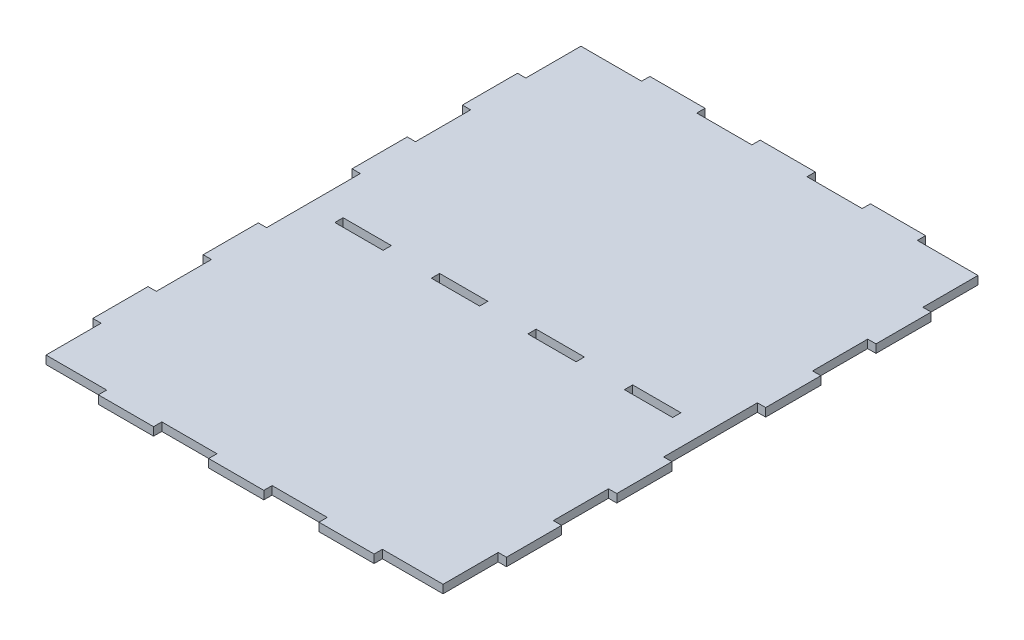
ISO-10303-21;
HEADER;
FILE_DESCRIPTION(('STEP AP214'),'2;1');
FILE_NAME('part.step','',(''),(''),'','','');
FILE_SCHEMA(('AUTOMOTIVE_DESIGN { 1 0 10303 214 1 1 1 1 }'));
ENDSEC;
DATA;
#1=APPLICATION_CONTEXT('core data for automotive mechanical design processes');
#2=APPLICATION_PROTOCOL_DEFINITION('international standard','automotive_design',2000,#1);
#3=PRODUCT_CONTEXT('',#1,'mechanical');
#4=PRODUCT('Part','Part','',(#3));
#5=PRODUCT_RELATED_PRODUCT_CATEGORY('part','',(#4));
#6=PRODUCT_DEFINITION_FORMATION('','',#4);
#7=PRODUCT_DEFINITION_CONTEXT('part definition',#1,'design');
#8=PRODUCT_DEFINITION('design','',#6,#7);
#9=PRODUCT_DEFINITION_SHAPE('','',#8);
#10=(LENGTH_UNIT() NAMED_UNIT(*) SI_UNIT(.MILLI.,.METRE.));
#11=(NAMED_UNIT(*) PLANE_ANGLE_UNIT() SI_UNIT($,.RADIAN.));
#12=(NAMED_UNIT(*) SI_UNIT($,.STERADIAN.) SOLID_ANGLE_UNIT());
#13=UNCERTAINTY_MEASURE_WITH_UNIT(LENGTH_MEASURE(1.E-05),#10,'distance_accuracy_value','');
#14=(GEOMETRIC_REPRESENTATION_CONTEXT(3) GLOBAL_UNCERTAINTY_ASSIGNED_CONTEXT((#13)) GLOBAL_UNIT_ASSIGNED_CONTEXT((#10,
#11,#12)) REPRESENTATION_CONTEXT('',''));
#15=CARTESIAN_POINT('',(0.,0.,0.));
#16=DIRECTION('',(0.,0.,1.));
#17=DIRECTION('',(1.,0.,0.));
#18=AXIS2_PLACEMENT_3D('',#15,#16,#17);
#19=CARTESIAN_POINT('',(0.,12.,0.));
#20=DIRECTION('',(1.,0.,0.));
#21=DIRECTION('',(0.,0.,-1.));
#22=AXIS2_PLACEMENT_3D('',#19,#20,#21);
#23=PLANE('',#22);
#24=DIRECTION('',(0.,0.,1.));
#25=VECTOR('',#24,1.);
#26=CARTESIAN_POINT('',(0.,0.,0.));
#27=LINE('',#26,#25);
#28=CARTESIAN_POINT('',(0.,0.,-332.));
#29=VERTEX_POINT('',#28);
#30=CARTESIAN_POINT('',(0.,0.,-252.));
#31=VERTEX_POINT('',#30);
#32=EDGE_CURVE('E1070',#29,#31,#27,.T.);
#33=ORIENTED_EDGE('',*,*,#32,.T.);
#34=DIRECTION('',(0.,1.,0.));
#35=VECTOR('',#34,1.);
#36=CARTESIAN_POINT('',(0.,0.,-252.));
#37=LINE('',#36,#35);
#38=CARTESIAN_POINT('',(0.,12.,-252.));
#39=VERTEX_POINT('',#38);
#40=EDGE_CURVE('E753',#31,#39,#37,.T.);
#41=ORIENTED_EDGE('',*,*,#40,.T.);
#42=DIRECTION('',(0.,0.,1.));
#43=VECTOR('',#42,1.);
#44=CARTESIAN_POINT('',(0.,12.,0.));
#45=LINE('',#44,#43);
#46=CARTESIAN_POINT('',(0.,12.,-332.));
#47=VERTEX_POINT('',#46);
#48=EDGE_CURVE('E1054',#47,#39,#45,.T.);
#49=ORIENTED_EDGE('',*,*,#48,.F.);
#50=DIRECTION('',(0.,1.,0.));
#51=VECTOR('',#50,1.);
#52=CARTESIAN_POINT('',(0.,0.,-332.));
#53=LINE('',#52,#51);
#54=EDGE_CURVE('E733',#29,#47,#53,.T.);
#55=ORIENTED_EDGE('',*,*,#54,.F.);
#56=EDGE_LOOP('',(#33,#41,#49,#55));
#57=FACE_BOUND('',#56,.T.);
#58=ADVANCED_FACE('F45',(#57),#23,.F.);
#59=CARTESIAN_POINT('',(0.,12.,-708.));
#60=VERTEX_POINT('',#59);
#61=CARTESIAN_POINT('',(0.,12.,-628.));
#62=VERTEX_POINT('',#61);
#63=EDGE_CURVE('E1056',#60,#62,#45,.T.);
#64=ORIENTED_EDGE('',*,*,#63,.F.);
#65=DIRECTION('',(0.,1.,0.));
#66=VECTOR('',#65,1.);
#67=CARTESIAN_POINT('',(0.,0.,-708.));
#68=LINE('',#67,#66);
#69=CARTESIAN_POINT('',(0.,0.,-708.));
#70=VERTEX_POINT('',#69);
#71=EDGE_CURVE('E847',#70,#60,#68,.T.);
#72=ORIENTED_EDGE('',*,*,#71,.F.);
#73=CARTESIAN_POINT('',(0.,0.,-628.));
#74=VERTEX_POINT('',#73);
#75=EDGE_CURVE('E1071',#70,#74,#27,.T.);
#76=ORIENTED_EDGE('',*,*,#75,.T.);
#77=DIRECTION('',(0.,1.,0.));
#78=VECTOR('',#77,1.);
#79=CARTESIAN_POINT('',(0.,0.,-628.));
#80=LINE('',#79,#78);
#81=EDGE_CURVE('E655',#74,#62,#80,.T.);
#82=ORIENTED_EDGE('',*,*,#81,.T.);
#83=EDGE_LOOP('',(#64,#72,#76,#82));
#84=FACE_BOUND('',#83,.T.);
#85=ADVANCED_FACE('F1190',(#84),#23,.F.);
#86=CARTESIAN_POINT('',(0.,12.,-548.));
#87=VERTEX_POINT('',#86);
#88=CARTESIAN_POINT('',(0.,12.,-468.));
#89=VERTEX_POINT('',#88);
#90=EDGE_CURVE('E1220',#87,#89,#45,.T.);
#91=ORIENTED_EDGE('',*,*,#90,.F.);
#92=DIRECTION('',(0.,1.,0.));
#93=VECTOR('',#92,1.);
#94=CARTESIAN_POINT('',(0.,0.,-548.));
#95=LINE('',#94,#93);
#96=CARTESIAN_POINT('',(0.,0.,-548.));
#97=VERTEX_POINT('',#96);
#98=EDGE_CURVE('E659',#97,#87,#95,.T.);
#99=ORIENTED_EDGE('',*,*,#98,.F.);
#100=CARTESIAN_POINT('',(0.,0.,-468.));
#101=VERTEX_POINT('',#100);
#102=EDGE_CURVE('E2125',#97,#101,#27,.T.);
#103=ORIENTED_EDGE('',*,*,#102,.T.);
#104=DIRECTION('',(0.,1.,0.));
#105=VECTOR('',#104,1.);
#106=CARTESIAN_POINT('',(0.,0.,-468.));
#107=LINE('',#106,#105);
#108=EDGE_CURVE('E740',#101,#89,#107,.T.);
#109=ORIENTED_EDGE('',*,*,#108,.T.);
#110=EDGE_LOOP('',(#91,#99,#103,#109));
#111=FACE_BOUND('',#110,.T.);
#112=ADVANCED_FACE('F1195',(#111),#23,.F.);
#113=CARTESIAN_POINT('',(0.,12.,0.));
#114=DIRECTION('',(0.,0.,-1.));
#115=DIRECTION('',(-1.,0.,0.));
#116=AXIS2_PLACEMENT_3D('',#113,#114,#115);
#117=PLANE('',#116);
#118=DIRECTION('',(1.,0.,0.));
#119=VECTOR('',#118,1.);
#120=CARTESIAN_POINT('',(0.,0.,0.));
#121=LINE('',#120,#119);
#122=CARTESIAN_POINT('',(100.,0.,0.));
#123=VERTEX_POINT('',#122);
#124=CARTESIAN_POINT('',(180.,0.,0.));
#125=VERTEX_POINT('',#124);
#126=EDGE_CURVE('E1075',#123,#125,#121,.T.);
#127=ORIENTED_EDGE('',*,*,#126,.T.);
#128=DIRECTION('',(0.,1.,0.));
#129=VECTOR('',#128,1.);
#130=CARTESIAN_POINT('',(180.,0.,0.));
#131=LINE('',#130,#129);
#132=CARTESIAN_POINT('',(180.,12.,0.));
#133=VERTEX_POINT('',#132);
#134=EDGE_CURVE('E957',#125,#133,#131,.T.);
#135=ORIENTED_EDGE('',*,*,#134,.T.);
#136=DIRECTION('',(1.,0.,0.));
#137=VECTOR('',#136,1.);
#138=CARTESIAN_POINT('',(0.,12.,0.));
#139=LINE('',#138,#137);
#140=CARTESIAN_POINT('',(100.,12.,0.));
#141=VERTEX_POINT('',#140);
#142=EDGE_CURVE('E1061',#141,#133,#139,.T.);
#143=ORIENTED_EDGE('',*,*,#142,.F.);
#144=DIRECTION('',(0.,1.,0.));
#145=VECTOR('',#144,1.);
#146=CARTESIAN_POINT('',(100.,0.,0.));
#147=LINE('',#146,#145);
#148=EDGE_CURVE('E1030',#123,#141,#147,.T.);
#149=ORIENTED_EDGE('',*,*,#148,.F.);
#150=EDGE_LOOP('',(#127,#135,#143,#149));
#151=FACE_BOUND('',#150,.T.);
#152=ADVANCED_FACE('F1206',(#151),#117,.F.);
#153=CARTESIAN_POINT('',(260.,12.,0.));
#154=VERTEX_POINT('',#153);
#155=CARTESIAN_POINT('',(340.,12.,0.));
#156=VERTEX_POINT('',#155);
#157=EDGE_CURVE('E1060',#154,#156,#139,.T.);
#158=ORIENTED_EDGE('',*,*,#157,.F.);
#159=DIRECTION('',(0.,1.,0.));
#160=VECTOR('',#159,1.);
#161=CARTESIAN_POINT('',(260.,0.,0.));
#162=LINE('',#161,#160);
#163=CARTESIAN_POINT('',(260.,0.,0.));
#164=VERTEX_POINT('',#163);
#165=EDGE_CURVE('E961',#164,#154,#162,.T.);
#166=ORIENTED_EDGE('',*,*,#165,.F.);
#167=CARTESIAN_POINT('',(340.,0.,0.));
#168=VERTEX_POINT('',#167);
#169=EDGE_CURVE('E1074',#164,#168,#121,.T.);
#170=ORIENTED_EDGE('',*,*,#169,.T.);
#171=DIRECTION('',(0.,1.,0.));
#172=VECTOR('',#171,1.);
#173=CARTESIAN_POINT('',(340.,0.,0.));
#174=LINE('',#173,#172);
#175=EDGE_CURVE('E905',#168,#156,#174,.T.);
#176=ORIENTED_EDGE('',*,*,#175,.T.);
#177=EDGE_LOOP('',(#158,#166,#170,#176));
#178=FACE_BOUND('',#177,.T.);
#179=ADVANCED_FACE('F1207',(#178),#117,.F.);
#180=CARTESIAN_POINT('',(600.,12.,0.));
#181=DIRECTION('',(-1.,0.,0.));
#182=DIRECTION('',(0.,0.,1.));
#183=AXIS2_PLACEMENT_3D('',#180,#181,#182);
#184=PLANE('',#183);
#185=DIRECTION('',(0.,0.,-1.));
#186=VECTOR('',#185,1.);
#187=CARTESIAN_POINT('',(600.,0.,0.));
#188=LINE('',#187,#186);
#189=CARTESIAN_POINT('',(600.,0.,-252.));
#190=VERTEX_POINT('',#189);
#191=CARTESIAN_POINT('',(600.,0.,-332.));
#192=VERTEX_POINT('',#191);
#193=EDGE_CURVE('E1084',#190,#192,#188,.T.);
#194=ORIENTED_EDGE('',*,*,#193,.T.);
#195=DIRECTION('',(0.,1.,0.));
#196=VECTOR('',#195,1.);
#197=CARTESIAN_POINT('',(600.,0.,-332.));
#198=LINE('',#197,#196);
#199=CARTESIAN_POINT('',(600.,12.,-332.));
#200=VERTEX_POINT('',#199);
#201=EDGE_CURVE('E761',#192,#200,#198,.T.);
#202=ORIENTED_EDGE('',*,*,#201,.T.);
#203=DIRECTION('',(0.,0.,-1.));
#204=VECTOR('',#203,1.);
#205=CARTESIAN_POINT('',(600.,12.,0.));
#206=LINE('',#205,#204);
#207=CARTESIAN_POINT('',(600.,12.,-252.));
#208=VERTEX_POINT('',#207);
#209=EDGE_CURVE('E1110',#208,#200,#206,.T.);
#210=ORIENTED_EDGE('',*,*,#209,.F.);
#211=DIRECTION('',(0.,1.,0.));
#212=VECTOR('',#211,1.);
#213=CARTESIAN_POINT('',(600.,0.,-252.));
#214=LINE('',#213,#212);
#215=EDGE_CURVE('E685',#190,#208,#214,.T.);
#216=ORIENTED_EDGE('',*,*,#215,.F.);
#217=EDGE_LOOP('',(#194,#202,#210,#216));
#218=FACE_BOUND('',#217,.T.);
#219=ADVANCED_FACE('F1096',(#218),#184,.F.);
#220=CARTESIAN_POINT('',(600.,12.,-92.));
#221=VERTEX_POINT('',#220);
#222=CARTESIAN_POINT('',(600.,12.,-172.));
#223=VERTEX_POINT('',#222);
#224=EDGE_CURVE('E1065',#221,#223,#206,.T.);
#225=ORIENTED_EDGE('',*,*,#224,.F.);
#226=DIRECTION('',(0.,1.,0.));
#227=VECTOR('',#226,1.);
#228=CARTESIAN_POINT('',(600.,0.,-92.));
#229=LINE('',#228,#227);
#230=CARTESIAN_POINT('',(600.,0.,-92.));
#231=VERTEX_POINT('',#230);
#232=EDGE_CURVE('E817',#231,#221,#229,.T.);
#233=ORIENTED_EDGE('',*,*,#232,.F.);
#234=CARTESIAN_POINT('',(600.,0.,-172.));
#235=VERTEX_POINT('',#234);
#236=EDGE_CURVE('E1079',#231,#235,#188,.T.);
#237=ORIENTED_EDGE('',*,*,#236,.T.);
#238=DIRECTION('',(0.,1.,0.));
#239=VECTOR('',#238,1.);
#240=CARTESIAN_POINT('',(600.,0.,-172.));
#241=LINE('',#240,#239);
#242=EDGE_CURVE('E681',#235,#223,#241,.T.);
#243=ORIENTED_EDGE('',*,*,#242,.T.);
#244=EDGE_LOOP('',(#225,#233,#237,#243));
#245=FACE_BOUND('',#244,.T.);
#246=ADVANCED_FACE('F1305',(#245),#184,.F.);
#247=CARTESIAN_POINT('',(600.,12.,-468.));
#248=VERTEX_POINT('',#247);
#249=CARTESIAN_POINT('',(600.,12.,-548.));
#250=VERTEX_POINT('',#249);
#251=EDGE_CURVE('E1064',#248,#250,#206,.T.);
#252=ORIENTED_EDGE('',*,*,#251,.F.);
#253=DIRECTION('',(0.,1.,0.));
#254=VECTOR('',#253,1.);
#255=CARTESIAN_POINT('',(600.,0.,-468.));
#256=LINE('',#255,#254);
#257=CARTESIAN_POINT('',(600.,0.,-468.));
#258=VERTEX_POINT('',#257);
#259=EDGE_CURVE('E765',#258,#248,#256,.T.);
#260=ORIENTED_EDGE('',*,*,#259,.F.);
#261=CARTESIAN_POINT('',(600.,0.,-548.));
#262=VERTEX_POINT('',#261);
#263=EDGE_CURVE('E1078',#258,#262,#188,.T.);
#264=ORIENTED_EDGE('',*,*,#263,.T.);
#265=DIRECTION('',(0.,1.,0.));
#266=VECTOR('',#265,1.);
#267=CARTESIAN_POINT('',(600.,0.,-548.));
#268=LINE('',#267,#266);
#269=EDGE_CURVE('E673',#262,#250,#268,.T.);
#270=ORIENTED_EDGE('',*,*,#269,.T.);
#271=EDGE_LOOP('',(#252,#260,#264,#270));
#272=FACE_BOUND('',#271,.T.);
#273=ADVANCED_FACE('F1119',(#272),#184,.F.);
#274=CARTESIAN_POINT('',(0.,12.,-800.));
#275=DIRECTION('',(0.,0.,1.));
#276=DIRECTION('',(1.,0.,0.));
#277=AXIS2_PLACEMENT_3D('',#274,#275,#276);
#278=PLANE('',#277);
#279=DIRECTION('',(-1.,0.,0.));
#280=VECTOR('',#279,1.);
#281=CARTESIAN_POINT('',(0.,0.,-800.));
#282=LINE('',#281,#280);
#283=CARTESIAN_POINT('',(340.,0.,-800.));
#284=VERTEX_POINT('',#283);
#285=CARTESIAN_POINT('',(260.,0.,-800.));
#286=VERTEX_POINT('',#285);
#287=EDGE_CURVE('E1091',#284,#286,#282,.T.);
#288=ORIENTED_EDGE('',*,*,#287,.T.);
#289=DIRECTION('',(0.,1.,0.));
#290=VECTOR('',#289,1.);
#291=CARTESIAN_POINT('',(260.,0.,-800.));
#292=LINE('',#291,#290);
#293=CARTESIAN_POINT('',(260.,12.,-800.));
#294=VERTEX_POINT('',#293);
#295=EDGE_CURVE('E792',#286,#294,#292,.T.);
#296=ORIENTED_EDGE('',*,*,#295,.T.);
#297=DIRECTION('',(-1.,0.,0.));
#298=VECTOR('',#297,1.);
#299=CARTESIAN_POINT('',(0.,12.,-800.));
#300=LINE('',#299,#298);
#301=CARTESIAN_POINT('',(340.,12.,-800.));
#302=VERTEX_POINT('',#301);
#303=EDGE_CURVE('E54',#302,#294,#300,.T.);
#304=ORIENTED_EDGE('',*,*,#303,.F.);
#305=DIRECTION('',(0.,1.,0.));
#306=VECTOR('',#305,1.);
#307=CARTESIAN_POINT('',(340.,0.,-800.));
#308=LINE('',#307,#306);
#309=EDGE_CURVE('E933',#284,#302,#308,.T.);
#310=ORIENTED_EDGE('',*,*,#309,.F.);
#311=EDGE_LOOP('',(#288,#296,#304,#310));
#312=FACE_BOUND('',#311,.T.);
#313=ADVANCED_FACE('F1158',(#312),#278,.F.);
#314=CARTESIAN_POINT('',(500.,12.,-800.));
#315=VERTEX_POINT('',#314);
#316=CARTESIAN_POINT('',(420.,12.,-800.));
#317=VERTEX_POINT('',#316);
#318=EDGE_CURVE('E11',#315,#317,#300,.T.);
#319=ORIENTED_EDGE('',*,*,#318,.F.);
#320=DIRECTION('',(0.,1.,0.));
#321=VECTOR('',#320,1.);
#322=CARTESIAN_POINT('',(500.,0.,-800.));
#323=LINE('',#322,#321);
#324=CARTESIAN_POINT('',(500.,0.,-800.));
#325=VERTEX_POINT('',#324);
#326=EDGE_CURVE('E985',#325,#315,#323,.T.);
#327=ORIENTED_EDGE('',*,*,#326,.F.);
#328=CARTESIAN_POINT('',(420.,0.,-800.));
#329=VERTEX_POINT('',#328);
#330=EDGE_CURVE('E1055',#325,#329,#282,.T.);
#331=ORIENTED_EDGE('',*,*,#330,.T.);
#332=DIRECTION('',(0.,1.,0.));
#333=VECTOR('',#332,1.);
#334=CARTESIAN_POINT('',(420.,0.,-800.));
#335=LINE('',#334,#333);
#336=EDGE_CURVE('E805',#329,#317,#335,.T.);
#337=ORIENTED_EDGE('',*,*,#336,.T.);
#338=EDGE_LOOP('',(#319,#327,#331,#337));
#339=FACE_BOUND('',#338,.T.);
#340=ADVANCED_FACE('F1152',(#339),#278,.F.);
#341=CARTESIAN_POINT('',(0.,12.,-172.));
#342=VERTEX_POINT('',#341);
#343=CARTESIAN_POINT('',(0.,12.,-92.));
#344=VERTEX_POINT('',#343);
#345=EDGE_CURVE('E1051',#342,#344,#45,.T.);
#346=ORIENTED_EDGE('',*,*,#345,.F.);
#347=DIRECTION('',(0.,1.,0.));
#348=VECTOR('',#347,1.);
#349=CARTESIAN_POINT('',(0.,0.,-172.));
#350=LINE('',#349,#348);
#351=CARTESIAN_POINT('',(0.,0.,-172.));
#352=VERTEX_POINT('',#351);
#353=EDGE_CURVE('E881',#352,#342,#350,.T.);
#354=ORIENTED_EDGE('',*,*,#353,.F.);
#355=CARTESIAN_POINT('',(0.,0.,-92.));
#356=VERTEX_POINT('',#355);
#357=EDGE_CURVE('E1043',#352,#356,#27,.T.);
#358=ORIENTED_EDGE('',*,*,#357,.T.);
#359=DIRECTION('',(0.,1.,0.));
#360=VECTOR('',#359,1.);
#361=CARTESIAN_POINT('',(0.,0.,-92.));
#362=LINE('',#361,#360);
#363=EDGE_CURVE('E1040',#356,#344,#362,.T.);
#364=ORIENTED_EDGE('',*,*,#363,.T.);
#365=EDGE_LOOP('',(#346,#354,#358,#364));
#366=FACE_BOUND('',#365,.T.);
#367=ADVANCED_FACE('F47',(#366),#23,.F.);
#368=CARTESIAN_POINT('',(420.,0.,0.));
#369=VERTEX_POINT('',#368);
#370=CARTESIAN_POINT('',(500.,0.,0.));
#371=VERTEX_POINT('',#370);
#372=EDGE_CURVE('E1072',#369,#371,#121,.T.);
#373=ORIENTED_EDGE('',*,*,#372,.T.);
#374=DIRECTION('',(0.,1.,0.));
#375=VECTOR('',#374,1.);
#376=CARTESIAN_POINT('',(500.,0.,0.));
#377=LINE('',#376,#375);
#378=CARTESIAN_POINT('',(500.,12.,0.));
#379=VERTEX_POINT('',#378);
#380=EDGE_CURVE('E813',#371,#379,#377,.T.);
#381=ORIENTED_EDGE('',*,*,#380,.T.);
#382=CARTESIAN_POINT('',(420.,12.,0.));
#383=VERTEX_POINT('',#382);
#384=EDGE_CURVE('E1057',#383,#379,#139,.T.);
#385=ORIENTED_EDGE('',*,*,#384,.F.);
#386=DIRECTION('',(0.,1.,0.));
#387=VECTOR('',#386,1.);
#388=CARTESIAN_POINT('',(420.,0.,0.));
#389=LINE('',#388,#387);
#390=EDGE_CURVE('E909',#369,#383,#389,.T.);
#391=ORIENTED_EDGE('',*,*,#390,.F.);
#392=EDGE_LOOP('',(#373,#381,#385,#391));
#393=FACE_BOUND('',#392,.T.);
#394=ADVANCED_FACE('F1199',(#393),#117,.F.);
#395=CARTESIAN_POINT('',(600.,0.,-628.));
#396=VERTEX_POINT('',#395);
#397=CARTESIAN_POINT('',(600.,0.,-708.));
#398=VERTEX_POINT('',#397);
#399=EDGE_CURVE('E1076',#396,#398,#188,.T.);
#400=ORIENTED_EDGE('',*,*,#399,.T.);
#401=DIRECTION('',(0.,1.,0.));
#402=VECTOR('',#401,1.);
#403=CARTESIAN_POINT('',(600.,0.,-708.));
#404=LINE('',#403,#402);
#405=CARTESIAN_POINT('',(600.,12.,-708.));
#406=VERTEX_POINT('',#405);
#407=EDGE_CURVE('E925',#398,#406,#404,.T.);
#408=ORIENTED_EDGE('',*,*,#407,.T.);
#409=CARTESIAN_POINT('',(600.,12.,-628.));
#410=VERTEX_POINT('',#409);
#411=EDGE_CURVE('E1062',#410,#406,#206,.T.);
#412=ORIENTED_EDGE('',*,*,#411,.F.);
#413=DIRECTION('',(0.,1.,0.));
#414=VECTOR('',#413,1.);
#415=CARTESIAN_POINT('',(600.,0.,-628.));
#416=LINE('',#415,#414);
#417=EDGE_CURVE('E709',#396,#410,#416,.T.);
#418=ORIENTED_EDGE('',*,*,#417,.F.);
#419=EDGE_LOOP('',(#400,#408,#412,#418));
#420=FACE_BOUND('',#419,.T.);
#421=ADVANCED_FACE('F1132',(#420),#184,.F.);
#422=CARTESIAN_POINT('',(180.,0.,-800.));
#423=VERTEX_POINT('',#422);
#424=CARTESIAN_POINT('',(100.,0.,-800.));
#425=VERTEX_POINT('',#424);
#426=EDGE_CURVE('E49',#423,#425,#282,.T.);
#427=ORIENTED_EDGE('',*,*,#426,.T.);
#428=DIRECTION('',(0.,1.,0.));
#429=VECTOR('',#428,1.);
#430=CARTESIAN_POINT('',(100.,0.,-800.));
#431=LINE('',#430,#429);
#432=CARTESIAN_POINT('',(100.,12.,-800.));
#433=VERTEX_POINT('',#432);
#434=EDGE_CURVE('E856',#425,#433,#431,.T.);
#435=ORIENTED_EDGE('',*,*,#434,.T.);
#436=CARTESIAN_POINT('',(180.,12.,-800.));
#437=VERTEX_POINT('',#436);
#438=EDGE_CURVE('E56',#437,#433,#300,.T.);
#439=ORIENTED_EDGE('',*,*,#438,.F.);
#440=DIRECTION('',(0.,1.,0.));
#441=VECTOR('',#440,1.);
#442=CARTESIAN_POINT('',(180.,0.,-800.));
#443=LINE('',#442,#441);
#444=EDGE_CURVE('E785',#423,#437,#443,.T.);
#445=ORIENTED_EDGE('',*,*,#444,.F.);
#446=EDGE_LOOP('',(#427,#435,#439,#445));
#447=FACE_BOUND('',#446,.T.);
#448=ADVANCED_FACE('F1209',(#447),#278,.F.);
#449=CARTESIAN_POINT('',(0.,12.,0.));
#450=DIRECTION('',(0.,-1.,0.));
#451=DIRECTION('',(0.,0.,-1.));
#452=AXIS2_PLACEMENT_3D('',#449,#450,#451);
#453=PLANE('',#452);
#454=DIRECTION('',(1.,0.,0.));
#455=VECTOR('',#454,1.);
#456=CARTESIAN_POINT('',(55.0000000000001,12.,-388.));
#457=LINE('',#456,#455);
#458=CARTESIAN_POINT('',(55.0000000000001,12.,-388.));
#459=VERTEX_POINT('',#458);
#460=CARTESIAN_POINT('',(125.,12.,-388.));
#461=VERTEX_POINT('',#460);
#462=EDGE_CURVE('E551',#459,#461,#457,.T.);
#463=ORIENTED_EDGE('',*,*,#462,.F.);
#464=DIRECTION('',(0.,0.,1.));
#465=VECTOR('',#464,1.);
#466=CARTESIAN_POINT('',(55.0000000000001,12.,-400.));
#467=LINE('',#466,#465);
#468=CARTESIAN_POINT('',(55.0000000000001,12.,-400.));
#469=VERTEX_POINT('',#468);
#470=EDGE_CURVE('E63',#469,#459,#467,.T.);
#471=ORIENTED_EDGE('',*,*,#470,.F.);
#472=DIRECTION('',(-1.,0.,0.));
#473=VECTOR('',#472,1.);
#474=CARTESIAN_POINT('',(55.0000000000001,12.,-400.));
#475=LINE('',#474,#473);
#476=CARTESIAN_POINT('',(125.,12.,-400.));
#477=VERTEX_POINT('',#476);
#478=EDGE_CURVE('E542',#477,#469,#475,.T.);
#479=ORIENTED_EDGE('',*,*,#478,.F.);
#480=DIRECTION('',(0.,0.,-1.));
#481=VECTOR('',#480,1.);
#482=CARTESIAN_POINT('',(125.,12.,-400.));
#483=LINE('',#482,#481);
#484=EDGE_CURVE('E545',#461,#477,#483,.T.);
#485=ORIENTED_EDGE('',*,*,#484,.F.);
#486=EDGE_LOOP('',(#463,#471,#479,#485));
#487=FACE_BOUND('',#486,.T.);
#488=DIRECTION('',(1.,0.,0.));
#489=VECTOR('',#488,1.);
#490=CARTESIAN_POINT('',(195.,12.,-388.));
#491=LINE('',#490,#489);
#492=CARTESIAN_POINT('',(195.,12.,-388.));
#493=VERTEX_POINT('',#492);
#494=CARTESIAN_POINT('',(265.,12.,-388.));
#495=VERTEX_POINT('',#494);
#496=EDGE_CURVE('E578',#493,#495,#491,.T.);
#497=ORIENTED_EDGE('',*,*,#496,.F.);
#498=DIRECTION('',(0.,0.,1.));
#499=VECTOR('',#498,1.);
#500=CARTESIAN_POINT('',(195.,12.,-400.));
#501=LINE('',#500,#499);
#502=CARTESIAN_POINT('',(195.,12.,-400.));
#503=VERTEX_POINT('',#502);
#504=EDGE_CURVE('E71',#503,#493,#501,.T.);
#505=ORIENTED_EDGE('',*,*,#504,.F.);
#506=DIRECTION('',(-1.,0.,0.));
#507=VECTOR('',#506,1.);
#508=CARTESIAN_POINT('',(195.,12.,-400.));
#509=LINE('',#508,#507);
#510=CARTESIAN_POINT('',(265.,12.,-400.));
#511=VERTEX_POINT('',#510);
#512=EDGE_CURVE('E571',#511,#503,#509,.T.);
#513=ORIENTED_EDGE('',*,*,#512,.F.);
#514=DIRECTION('',(0.,0.,-1.));
#515=VECTOR('',#514,1.);
#516=CARTESIAN_POINT('',(265.,12.,-400.));
#517=LINE('',#516,#515);
#518=EDGE_CURVE('E574',#495,#511,#517,.T.);
#519=ORIENTED_EDGE('',*,*,#518,.F.);
#520=EDGE_LOOP('',(#497,#505,#513,#519));
#521=FACE_BOUND('',#520,.T.);
#522=DIRECTION('',(1.,0.,0.));
#523=VECTOR('',#522,1.);
#524=CARTESIAN_POINT('',(335.,12.,-388.));
#525=LINE('',#524,#523);
#526=CARTESIAN_POINT('',(335.,12.,-388.));
#527=VERTEX_POINT('',#526);
#528=CARTESIAN_POINT('',(405.,12.,-388.));
#529=VERTEX_POINT('',#528);
#530=EDGE_CURVE('E610',#527,#529,#525,.T.);
#531=ORIENTED_EDGE('',*,*,#530,.F.);
#532=DIRECTION('',(0.,0.,1.));
#533=VECTOR('',#532,1.);
#534=CARTESIAN_POINT('',(335.,12.,-400.));
#535=LINE('',#534,#533);
#536=CARTESIAN_POINT('',(335.,12.,-400.));
#537=VERTEX_POINT('',#536);
#538=EDGE_CURVE('E570',#537,#527,#535,.T.);
#539=ORIENTED_EDGE('',*,*,#538,.F.);
#540=DIRECTION('',(-1.,0.,0.));
#541=VECTOR('',#540,1.);
#542=CARTESIAN_POINT('',(335.,12.,-400.));
#543=LINE('',#542,#541);
#544=CARTESIAN_POINT('',(405.,12.,-400.));
#545=VERTEX_POINT('',#544);
#546=EDGE_CURVE('E603',#545,#537,#543,.T.);
#547=ORIENTED_EDGE('',*,*,#546,.F.);
#548=DIRECTION('',(0.,0.,-1.));
#549=VECTOR('',#548,1.);
#550=CARTESIAN_POINT('',(405.,12.,-400.));
#551=LINE('',#550,#549);
#552=EDGE_CURVE('E606',#529,#545,#551,.T.);
#553=ORIENTED_EDGE('',*,*,#552,.F.);
#554=EDGE_LOOP('',(#531,#539,#547,#553));
#555=FACE_BOUND('',#554,.T.);
#556=DIRECTION('',(1.,0.,0.));
#557=VECTOR('',#556,1.);
#558=CARTESIAN_POINT('',(475.,12.,-388.));
#559=LINE('',#558,#557);
#560=CARTESIAN_POINT('',(475.,12.,-388.));
#561=VERTEX_POINT('',#560);
#562=CARTESIAN_POINT('',(545.,12.,-388.));
#563=VERTEX_POINT('',#562);
#564=EDGE_CURVE('E641',#561,#563,#559,.T.);
#565=ORIENTED_EDGE('',*,*,#564,.F.);
#566=DIRECTION('',(0.,0.,1.));
#567=VECTOR('',#566,1.);
#568=CARTESIAN_POINT('',(475.,12.,-400.));
#569=LINE('',#568,#567);
#570=CARTESIAN_POINT('',(475.,12.,-400.));
#571=VERTEX_POINT('',#570);
#572=EDGE_CURVE('E602',#571,#561,#569,.T.);
#573=ORIENTED_EDGE('',*,*,#572,.F.);
#574=DIRECTION('',(-1.,0.,0.));
#575=VECTOR('',#574,1.);
#576=CARTESIAN_POINT('',(475.,12.,-400.));
#577=LINE('',#576,#575);
#578=CARTESIAN_POINT('',(545.,12.,-400.));
#579=VERTEX_POINT('',#578);
#580=EDGE_CURVE('E634',#579,#571,#577,.T.);
#581=ORIENTED_EDGE('',*,*,#580,.F.);
#582=DIRECTION('',(0.,0.,-1.));
#583=VECTOR('',#582,1.);
#584=CARTESIAN_POINT('',(545.,12.,-400.));
#585=LINE('',#584,#583);
#586=EDGE_CURVE('E637',#563,#579,#585,.T.);
#587=ORIENTED_EDGE('',*,*,#586,.F.);
#588=EDGE_LOOP('',(#565,#573,#581,#587));
#589=FACE_BOUND('',#588,.T.);
#590=ORIENTED_EDGE('',*,*,#48,.T.);
#591=DIRECTION('',(-1.,0.,0.));
#592=VECTOR('',#591,1.);
#593=CARTESIAN_POINT('',(0.,12.,-252.));
#594=LINE('',#593,#592);
#595=CARTESIAN_POINT('',(12.,12.,-252.));
#596=VERTEX_POINT('',#595);
#597=EDGE_CURVE('E890',#596,#39,#594,.T.);
#598=ORIENTED_EDGE('',*,*,#597,.F.);
#599=DIRECTION('',(0.,0.,-1.));
#600=VECTOR('',#599,1.);
#601=CARTESIAN_POINT('',(12.,12.,-172.));
#602=LINE('',#601,#600);
#603=CARTESIAN_POINT('',(12.,12.,-172.));
#604=VERTEX_POINT('',#603);
#605=EDGE_CURVE('E892',#604,#596,#602,.T.);
#606=ORIENTED_EDGE('',*,*,#605,.F.);
#607=DIRECTION('',(1.,0.,0.));
#608=VECTOR('',#607,1.);
#609=CARTESIAN_POINT('',(0.,12.,-172.));
#610=LINE('',#609,#608);
#611=EDGE_CURVE('E859',#342,#604,#610,.T.);
#612=ORIENTED_EDGE('',*,*,#611,.F.);
#613=ORIENTED_EDGE('',*,*,#345,.T.);
#614=DIRECTION('',(-1.,0.,0.));
#615=VECTOR('',#614,1.);
#616=CARTESIAN_POINT('',(0.,12.,-92.));
#617=LINE('',#616,#615);
#618=CARTESIAN_POINT('',(12.,12.,-92.));
#619=VERTEX_POINT('',#618);
#620=EDGE_CURVE('E1021',#619,#344,#617,.T.);
#621=ORIENTED_EDGE('',*,*,#620,.F.);
#622=DIRECTION('',(0.,0.,-1.));
#623=VECTOR('',#622,1.);
#624=CARTESIAN_POINT('',(12.,12.,-12.));
#625=LINE('',#624,#623);
#626=CARTESIAN_POINT('',(12.,12.,-12.));
#627=VERTEX_POINT('',#626);
#628=EDGE_CURVE('E1036',#627,#619,#625,.T.);
#629=ORIENTED_EDGE('',*,*,#628,.F.);
#630=DIRECTION('',(-1.,0.,0.));
#631=VECTOR('',#630,1.);
#632=CARTESIAN_POINT('',(12.,12.,-12.));
#633=LINE('',#632,#631);
#634=CARTESIAN_POINT('',(100.,12.,-12.));
#635=VERTEX_POINT('',#634);
#636=EDGE_CURVE('E1033',#635,#627,#633,.T.);
#637=ORIENTED_EDGE('',*,*,#636,.F.);
#638=DIRECTION('',(0.,0.,-1.));
#639=VECTOR('',#638,1.);
#640=CARTESIAN_POINT('',(100.,12.,0.));
#641=LINE('',#640,#639);
#642=EDGE_CURVE('E977',#141,#635,#641,.T.);
#643=ORIENTED_EDGE('',*,*,#642,.F.);
#644=ORIENTED_EDGE('',*,*,#142,.T.);
#645=DIRECTION('',(0.,0.,1.));
#646=VECTOR('',#645,1.);
#647=CARTESIAN_POINT('',(180.,12.,0.));
#648=LINE('',#647,#646);
#649=CARTESIAN_POINT('',(180.,12.,-12.));
#650=VERTEX_POINT('',#649);
#651=EDGE_CURVE('E975',#650,#133,#648,.T.);
#652=ORIENTED_EDGE('',*,*,#651,.F.);
#653=DIRECTION('',(-1.,0.,0.));
#654=VECTOR('',#653,1.);
#655=CARTESIAN_POINT('',(180.,12.,-12.));
#656=LINE('',#655,#654);
#657=CARTESIAN_POINT('',(260.,12.,-12.));
#658=VERTEX_POINT('',#657);
#659=EDGE_CURVE('E968',#658,#650,#656,.T.);
#660=ORIENTED_EDGE('',*,*,#659,.F.);
#661=DIRECTION('',(0.,0.,-1.));
#662=VECTOR('',#661,1.);
#663=CARTESIAN_POINT('',(260.,12.,0.));
#664=LINE('',#663,#662);
#665=EDGE_CURVE('E971',#154,#658,#664,.T.);
#666=ORIENTED_EDGE('',*,*,#665,.F.);
#667=ORIENTED_EDGE('',*,*,#157,.T.);
#668=DIRECTION('',(0.,0.,1.));
#669=VECTOR('',#668,1.);
#670=CARTESIAN_POINT('',(340.,12.,0.));
#671=LINE('',#670,#669);
#672=CARTESIAN_POINT('',(340.,12.,-12.));
#673=VERTEX_POINT('',#672);
#674=EDGE_CURVE('E923',#673,#156,#671,.T.);
#675=ORIENTED_EDGE('',*,*,#674,.F.);
#676=DIRECTION('',(-1.,0.,0.));
#677=VECTOR('',#676,1.);
#678=CARTESIAN_POINT('',(340.,12.,-12.));
#679=LINE('',#678,#677);
#680=CARTESIAN_POINT('',(420.,12.,-12.));
#681=VERTEX_POINT('',#680);
#682=EDGE_CURVE('E916',#681,#673,#679,.T.);
#683=ORIENTED_EDGE('',*,*,#682,.F.);
#684=DIRECTION('',(0.,0.,-1.));
#685=VECTOR('',#684,1.);
#686=CARTESIAN_POINT('',(420.,12.,0.));
#687=LINE('',#686,#685);
#688=EDGE_CURVE('E919',#383,#681,#687,.T.);
#689=ORIENTED_EDGE('',*,*,#688,.F.);
#690=ORIENTED_EDGE('',*,*,#384,.T.);
#691=DIRECTION('',(0.,0.,1.));
#692=VECTOR('',#691,1.);
#693=CARTESIAN_POINT('',(500.,12.,0.));
#694=LINE('',#693,#692);
#695=CARTESIAN_POINT('',(500.,12.,-12.));
#696=VERTEX_POINT('',#695);
#697=EDGE_CURVE('E795',#696,#379,#694,.T.);
#698=ORIENTED_EDGE('',*,*,#697,.F.);
#699=DIRECTION('',(-1.,0.,0.));
#700=VECTOR('',#699,1.);
#701=CARTESIAN_POINT('',(500.,12.,-12.));
#702=LINE('',#701,#700);
#703=CARTESIAN_POINT('',(588.,12.,-12.));
#704=VERTEX_POINT('',#703);
#705=EDGE_CURVE('E826',#704,#696,#702,.T.);
#706=ORIENTED_EDGE('',*,*,#705,.F.);
#707=DIRECTION('',(0.,0.,1.));
#708=VECTOR('',#707,1.);
#709=CARTESIAN_POINT('',(588.,12.,-12.));
#710=LINE('',#709,#708);
#711=CARTESIAN_POINT('',(588.,12.,-92.));
#712=VERTEX_POINT('',#711);
#713=EDGE_CURVE('E829',#712,#704,#710,.T.);
#714=ORIENTED_EDGE('',*,*,#713,.F.);
#715=DIRECTION('',(-1.,0.,0.));
#716=VECTOR('',#715,1.);
#717=CARTESIAN_POINT('',(600.,12.,-92.));
#718=LINE('',#717,#716);
#719=EDGE_CURVE('E833',#221,#712,#718,.T.);
#720=ORIENTED_EDGE('',*,*,#719,.F.);
#721=ORIENTED_EDGE('',*,*,#224,.T.);
#722=DIRECTION('',(1.,0.,0.));
#723=VECTOR('',#722,1.);
#724=CARTESIAN_POINT('',(600.,12.,-172.));
#725=LINE('',#724,#723);
#726=CARTESIAN_POINT('',(588.,12.,-172.));
#727=VERTEX_POINT('',#726);
#728=EDGE_CURVE('E699',#727,#223,#725,.T.);
#729=ORIENTED_EDGE('',*,*,#728,.F.);
#730=DIRECTION('',(0.,0.,1.));
#731=VECTOR('',#730,1.);
#732=CARTESIAN_POINT('',(588.,12.,-172.));
#733=LINE('',#732,#731);
#734=CARTESIAN_POINT('',(588.,12.,-252.));
#735=VERTEX_POINT('',#734);
#736=EDGE_CURVE('E692',#735,#727,#733,.T.);
#737=ORIENTED_EDGE('',*,*,#736,.F.);
#738=DIRECTION('',(-1.,0.,0.));
#739=VECTOR('',#738,1.);
#740=CARTESIAN_POINT('',(600.,12.,-252.));
#741=LINE('',#740,#739);
#742=EDGE_CURVE('E695',#208,#735,#741,.T.);
#743=ORIENTED_EDGE('',*,*,#742,.F.);
#744=ORIENTED_EDGE('',*,*,#209,.T.);
#745=DIRECTION('',(1.,0.,0.));
#746=VECTOR('',#745,1.);
#747=CARTESIAN_POINT('',(600.,12.,-332.));
#748=LINE('',#747,#746);
#749=CARTESIAN_POINT('',(588.,12.,-332.));
#750=VERTEX_POINT('',#749);
#751=EDGE_CURVE('E743',#750,#200,#748,.T.);
#752=ORIENTED_EDGE('',*,*,#751,.F.);
#753=DIRECTION('',(0.,0.,1.));
#754=VECTOR('',#753,1.);
#755=CARTESIAN_POINT('',(588.,12.,-332.));
#756=LINE('',#755,#754);
#757=CARTESIAN_POINT('',(588.,12.,-468.));
#758=VERTEX_POINT('',#757);
#759=EDGE_CURVE('E770',#758,#750,#756,.T.);
#760=ORIENTED_EDGE('',*,*,#759,.F.);
#761=DIRECTION('',(-1.,0.,0.));
#762=VECTOR('',#761,1.);
#763=CARTESIAN_POINT('',(600.,12.,-468.));
#764=LINE('',#763,#762);
#765=EDGE_CURVE('E773',#248,#758,#764,.T.);
#766=ORIENTED_EDGE('',*,*,#765,.F.);
#767=ORIENTED_EDGE('',*,*,#251,.T.);
#768=DIRECTION('',(1.,0.,0.));
#769=VECTOR('',#768,1.);
#770=CARTESIAN_POINT('',(600.,12.,-548.));
#771=LINE('',#770,#769);
#772=CARTESIAN_POINT('',(588.,12.,-548.));
#773=VERTEX_POINT('',#772);
#774=EDGE_CURVE('E718',#773,#250,#771,.T.);
#775=ORIENTED_EDGE('',*,*,#774,.F.);
#776=DIRECTION('',(0.,0.,1.));
#777=VECTOR('',#776,1.);
#778=CARTESIAN_POINT('',(588.,12.,-628.));
#779=LINE('',#778,#777);
#780=CARTESIAN_POINT('',(588.,12.,-628.));
#781=VERTEX_POINT('',#780);
#782=EDGE_CURVE('E720',#781,#773,#779,.T.);
#783=ORIENTED_EDGE('',*,*,#782,.F.);
#784=DIRECTION('',(-1.,0.,0.));
#785=VECTOR('',#784,1.);
#786=CARTESIAN_POINT('',(600.,12.,-628.));
#787=LINE('',#786,#785);
#788=EDGE_CURVE('E691',#410,#781,#787,.T.);
#789=ORIENTED_EDGE('',*,*,#788,.F.);
#790=ORIENTED_EDGE('',*,*,#411,.T.);
#791=DIRECTION('',(1.,0.,0.));
#792=VECTOR('',#791,1.);
#793=CARTESIAN_POINT('',(600.,12.,-708.));
#794=LINE('',#793,#792);
#795=CARTESIAN_POINT('',(588.,12.,-708.));
#796=VERTEX_POINT('',#795);
#797=EDGE_CURVE('E996',#796,#406,#794,.T.);
#798=ORIENTED_EDGE('',*,*,#797,.F.);
#799=DIRECTION('',(0.,0.,1.));
#800=VECTOR('',#799,1.);
#801=CARTESIAN_POINT('',(588.,12.,-708.));
#802=LINE('',#801,#800);
#803=CARTESIAN_POINT('',(588.,12.,-788.));
#804=VERTEX_POINT('',#803);
#805=EDGE_CURVE('E998',#804,#796,#802,.T.);
#806=ORIENTED_EDGE('',*,*,#805,.F.);
#807=DIRECTION('',(1.,0.,0.));
#808=VECTOR('',#807,1.);
#809=CARTESIAN_POINT('',(500.,12.,-788.));
#810=LINE('',#809,#808);
#811=CARTESIAN_POINT('',(500.,12.,-788.));
#812=VERTEX_POINT('',#811);
#813=EDGE_CURVE('E1002',#812,#804,#810,.T.);
#814=ORIENTED_EDGE('',*,*,#813,.F.);
#815=DIRECTION('',(0.,0.,1.));
#816=VECTOR('',#815,1.);
#817=CARTESIAN_POINT('',(500.,12.,-800.));
#818=LINE('',#817,#816);
#819=EDGE_CURVE('E967',#315,#812,#818,.T.);
#820=ORIENTED_EDGE('',*,*,#819,.F.);
#821=ORIENTED_EDGE('',*,*,#318,.T.);
#822=DIRECTION('',(0.,0.,-1.));
#823=VECTOR('',#822,1.);
#824=CARTESIAN_POINT('',(420.,12.,-800.));
#825=LINE('',#824,#823);
#826=CARTESIAN_POINT('',(420.,12.,-788.));
#827=VERTEX_POINT('',#826);
#828=EDGE_CURVE('E942',#827,#317,#825,.T.);
#829=ORIENTED_EDGE('',*,*,#828,.F.);
#830=DIRECTION('',(1.,0.,0.));
#831=VECTOR('',#830,1.);
#832=CARTESIAN_POINT('',(340.,12.,-788.));
#833=LINE('',#832,#831);
#834=CARTESIAN_POINT('',(340.,12.,-788.));
#835=VERTEX_POINT('',#834);
#836=EDGE_CURVE('E944',#835,#827,#833,.T.);
#837=ORIENTED_EDGE('',*,*,#836,.F.);
#838=DIRECTION('',(0.,0.,1.));
#839=VECTOR('',#838,1.);
#840=CARTESIAN_POINT('',(340.,12.,-800.));
#841=LINE('',#840,#839);
#842=EDGE_CURVE('E915',#302,#835,#841,.T.);
#843=ORIENTED_EDGE('',*,*,#842,.F.);
#844=ORIENTED_EDGE('',*,*,#303,.T.);
#845=DIRECTION('',(0.,0.,-1.));
#846=VECTOR('',#845,1.);
#847=CARTESIAN_POINT('',(260.,12.,-800.));
#848=LINE('',#847,#846);
#849=CARTESIAN_POINT('',(260.,12.,-788.));
#850=VERTEX_POINT('',#849);
#851=EDGE_CURVE('E796',#850,#294,#848,.T.);
#852=ORIENTED_EDGE('',*,*,#851,.F.);
#853=DIRECTION('',(1.,0.,0.));
#854=VECTOR('',#853,1.);
#855=CARTESIAN_POINT('',(180.,12.,-788.));
#856=LINE('',#855,#854);
#857=CARTESIAN_POINT('',(180.,12.,-788.));
#858=VERTEX_POINT('',#857);
#859=EDGE_CURVE('E798',#858,#850,#856,.T.);
#860=ORIENTED_EDGE('',*,*,#859,.F.);
#861=DIRECTION('',(0.,0.,1.));
#862=VECTOR('',#861,1.);
#863=CARTESIAN_POINT('',(180.,12.,-800.));
#864=LINE('',#863,#862);
#865=EDGE_CURVE('E802',#437,#858,#864,.T.);
#866=ORIENTED_EDGE('',*,*,#865,.F.);
#867=ORIENTED_EDGE('',*,*,#438,.T.);
#868=DIRECTION('',(0.,0.,-1.));
#869=VECTOR('',#868,1.);
#870=CARTESIAN_POINT('',(100.,12.,-800.));
#871=LINE('',#870,#869);
#872=CARTESIAN_POINT('',(100.,12.,-788.));
#873=VERTEX_POINT('',#872);
#874=EDGE_CURVE('E860',#873,#433,#871,.T.);
#875=ORIENTED_EDGE('',*,*,#874,.F.);
#876=DIRECTION('',(1.,0.,0.));
#877=VECTOR('',#876,1.);
#878=CARTESIAN_POINT('',(11.9999999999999,12.,-788.));
#879=LINE('',#878,#877);
#880=CARTESIAN_POINT('',(11.9999999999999,12.,-788.));
#881=VERTEX_POINT('',#880);
#882=EDGE_CURVE('E862',#881,#873,#879,.T.);
#883=ORIENTED_EDGE('',*,*,#882,.F.);
#884=DIRECTION('',(0.,0.,-1.));
#885=VECTOR('',#884,1.);
#886=CARTESIAN_POINT('',(11.9999999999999,12.,-708.));
#887=LINE('',#886,#885);
#888=CARTESIAN_POINT('',(11.9999999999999,12.,-708.));
#889=VERTEX_POINT('',#888);
#890=EDGE_CURVE('E866',#889,#881,#887,.T.);
#891=ORIENTED_EDGE('',*,*,#890,.F.);
#892=DIRECTION('',(1.,0.,0.));
#893=VECTOR('',#892,1.);
#894=CARTESIAN_POINT('',(0.,12.,-708.));
#895=LINE('',#894,#893);
#896=EDGE_CURVE('E825',#60,#889,#895,.T.);
#897=ORIENTED_EDGE('',*,*,#896,.F.);
#898=ORIENTED_EDGE('',*,*,#63,.T.);
#899=DIRECTION('',(-1.,0.,0.));
#900=VECTOR('',#899,1.);
#901=CARTESIAN_POINT('',(0.,12.,-628.));
#902=LINE('',#901,#900);
#903=CARTESIAN_POINT('',(11.9999999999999,12.,-628.));
#904=VERTEX_POINT('',#903);
#905=EDGE_CURVE('E671',#904,#62,#902,.T.);
#906=ORIENTED_EDGE('',*,*,#905,.F.);
#907=DIRECTION('',(0.,0.,-1.));
#908=VECTOR('',#907,1.);
#909=CARTESIAN_POINT('',(11.9999999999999,12.,-628.));
#910=LINE('',#909,#908);
#911=CARTESIAN_POINT('',(12.,12.,-548.));
#912=VERTEX_POINT('',#911);
#913=EDGE_CURVE('E664',#912,#904,#910,.T.);
#914=ORIENTED_EDGE('',*,*,#913,.F.);
#915=DIRECTION('',(1.,0.,0.));
#916=VECTOR('',#915,1.);
#917=CARTESIAN_POINT('',(0.,12.,-548.));
#918=LINE('',#917,#916);
#919=EDGE_CURVE('E667',#87,#912,#918,.T.);
#920=ORIENTED_EDGE('',*,*,#919,.F.);
#921=ORIENTED_EDGE('',*,*,#90,.T.);
#922=DIRECTION('',(-1.,0.,0.));
#923=VECTOR('',#922,1.);
#924=CARTESIAN_POINT('',(0.,12.,-468.));
#925=LINE('',#924,#923);
#926=CARTESIAN_POINT('',(12.0000000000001,12.,-468.));
#927=VERTEX_POINT('',#926);
#928=EDGE_CURVE('E744',#927,#89,#925,.T.);
#929=ORIENTED_EDGE('',*,*,#928,.F.);
#930=DIRECTION('',(0.,0.,-1.));
#931=VECTOR('',#930,1.);
#932=CARTESIAN_POINT('',(12.0000000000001,12.,-332.));
#933=LINE('',#932,#931);
#934=CARTESIAN_POINT('',(12.0000000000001,12.,-332.));
#935=VERTEX_POINT('',#934);
#936=EDGE_CURVE('E746',#935,#927,#933,.T.);
#937=ORIENTED_EDGE('',*,*,#936,.F.);
#938=DIRECTION('',(1.,0.,0.));
#939=VECTOR('',#938,1.);
#940=CARTESIAN_POINT('',(0.,12.,-332.));
#941=LINE('',#940,#939);
#942=EDGE_CURVE('E750',#47,#935,#941,.T.);
#943=ORIENTED_EDGE('',*,*,#942,.F.);
#944=EDGE_LOOP('',(#590,#598,#606,#612,#613,#621,#629,#637,#643,#644,#652,#660,#666,#667,#675,
#683,#689,#690,#698,#706,#714,#720,#721,#729,#737,#743,#744,#752,#760,#766,#767,#775,#783,#789,
#790,#798,#806,#814,#820,#821,#829,#837,#843,#844,#852,#860,#866,#867,#875,#883,#891,#897,#898,
#906,#914,#920,#921,#929,#937,#943));
#945=FACE_BOUND('',#944,.T.);
#946=ADVANCED_FACE('F1107',(#487,#521,#555,#589,#945),#453,.F.);
#947=CARTESIAN_POINT('',(0.,0.,0.));
#948=DIRECTION('',(0.,-1.,0.));
#949=DIRECTION('',(0.,0.,-1.));
#950=AXIS2_PLACEMENT_3D('',#947,#948,#949);
#951=PLANE('',#950);
#952=DIRECTION('',(0.,0.,1.));
#953=VECTOR('',#952,1.);
#954=CARTESIAN_POINT('',(55.0000000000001,0.,-400.));
#955=LINE('',#954,#953);
#956=CARTESIAN_POINT('',(55.0000000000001,0.,-400.));
#957=VERTEX_POINT('',#956);
#958=CARTESIAN_POINT('',(55.0000000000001,0.,-388.));
#959=VERTEX_POINT('',#958);
#960=EDGE_CURVE('E523',#957,#959,#955,.T.);
#961=ORIENTED_EDGE('',*,*,#960,.T.);
#962=DIRECTION('',(1.,0.,0.));
#963=VECTOR('',#962,1.);
#964=CARTESIAN_POINT('',(55.0000000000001,0.,-388.));
#965=LINE('',#964,#963);
#966=CARTESIAN_POINT('',(125.,0.,-388.));
#967=VERTEX_POINT('',#966);
#968=EDGE_CURVE('E533',#959,#967,#965,.T.);
#969=ORIENTED_EDGE('',*,*,#968,.T.);
#970=DIRECTION('',(0.,0.,-1.));
#971=VECTOR('',#970,1.);
#972=CARTESIAN_POINT('',(125.,0.,-400.));
#973=LINE('',#972,#971);
#974=CARTESIAN_POINT('',(125.,0.,-400.));
#975=VERTEX_POINT('',#974);
#976=EDGE_CURVE('E537',#967,#975,#973,.T.);
#977=ORIENTED_EDGE('',*,*,#976,.T.);
#978=DIRECTION('',(-1.,0.,0.));
#979=VECTOR('',#978,1.);
#980=CARTESIAN_POINT('',(55.0000000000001,0.,-400.));
#981=LINE('',#980,#979);
#982=EDGE_CURVE('E529',#975,#957,#981,.T.);
#983=ORIENTED_EDGE('',*,*,#982,.T.);
#984=EDGE_LOOP('',(#961,#969,#977,#983));
#985=FACE_BOUND('',#984,.T.);
#986=DIRECTION('',(0.,0.,1.));
#987=VECTOR('',#986,1.);
#988=CARTESIAN_POINT('',(195.,0.,-400.));
#989=LINE('',#988,#987);
#990=CARTESIAN_POINT('',(195.,0.,-400.));
#991=VERTEX_POINT('',#990);
#992=CARTESIAN_POINT('',(195.,0.,-388.));
#993=VERTEX_POINT('',#992);
#994=EDGE_CURVE('E575',#991,#993,#989,.T.);
#995=ORIENTED_EDGE('',*,*,#994,.T.);
#996=DIRECTION('',(1.,0.,0.));
#997=VECTOR('',#996,1.);
#998=CARTESIAN_POINT('',(195.,0.,-388.));
#999=LINE('',#998,#997);
#1000=CARTESIAN_POINT('',(265.,0.,-388.));
#1001=VERTEX_POINT('',#1000);
#1002=EDGE_CURVE('E587',#993,#1001,#999,.T.);
#1003=ORIENTED_EDGE('',*,*,#1002,.T.);
#1004=DIRECTION('',(0.,0.,-1.));
#1005=VECTOR('',#1004,1.);
#1006=CARTESIAN_POINT('',(265.,0.,-400.));
#1007=LINE('',#1006,#1005);
#1008=CARTESIAN_POINT('',(265.,0.,-400.));
#1009=VERTEX_POINT('',#1008);
#1010=EDGE_CURVE('E584',#1001,#1009,#1007,.T.);
#1011=ORIENTED_EDGE('',*,*,#1010,.T.);
#1012=DIRECTION('',(-1.,0.,0.));
#1013=VECTOR('',#1012,1.);
#1014=CARTESIAN_POINT('',(195.,0.,-400.));
#1015=LINE('',#1014,#1013);
#1016=EDGE_CURVE('E563',#1009,#991,#1015,.T.);
#1017=ORIENTED_EDGE('',*,*,#1016,.T.);
#1018=EDGE_LOOP('',(#995,#1003,#1011,#1017));
#1019=FACE_BOUND('',#1018,.T.);
#1020=DIRECTION('',(0.,0.,1.));
#1021=VECTOR('',#1020,1.);
#1022=CARTESIAN_POINT('',(335.,0.,-400.));
#1023=LINE('',#1022,#1021);
#1024=CARTESIAN_POINT('',(335.,0.,-400.));
#1025=VERTEX_POINT('',#1024);
#1026=CARTESIAN_POINT('',(335.,0.,-388.));
#1027=VERTEX_POINT('',#1026);
#1028=EDGE_CURVE('E607',#1025,#1027,#1023,.T.);
#1029=ORIENTED_EDGE('',*,*,#1028,.T.);
#1030=DIRECTION('',(1.,0.,0.));
#1031=VECTOR('',#1030,1.);
#1032=CARTESIAN_POINT('',(335.,0.,-388.));
#1033=LINE('',#1032,#1031);
#1034=CARTESIAN_POINT('',(405.,0.,-388.));
#1035=VERTEX_POINT('',#1034);
#1036=EDGE_CURVE('E619',#1027,#1035,#1033,.T.);
#1037=ORIENTED_EDGE('',*,*,#1036,.T.);
#1038=DIRECTION('',(0.,0.,-1.));
#1039=VECTOR('',#1038,1.);
#1040=CARTESIAN_POINT('',(405.,0.,-400.));
#1041=LINE('',#1040,#1039);
#1042=CARTESIAN_POINT('',(405.,0.,-400.));
#1043=VERTEX_POINT('',#1042);
#1044=EDGE_CURVE('E616',#1035,#1043,#1041,.T.);
#1045=ORIENTED_EDGE('',*,*,#1044,.T.);
#1046=DIRECTION('',(-1.,0.,0.));
#1047=VECTOR('',#1046,1.);
#1048=CARTESIAN_POINT('',(335.,0.,-400.));
#1049=LINE('',#1048,#1047);
#1050=EDGE_CURVE('E595',#1043,#1025,#1049,.T.);
#1051=ORIENTED_EDGE('',*,*,#1050,.T.);
#1052=EDGE_LOOP('',(#1029,#1037,#1045,#1051));
#1053=FACE_BOUND('',#1052,.T.);
#1054=DIRECTION('',(0.,0.,1.));
#1055=VECTOR('',#1054,1.);
#1056=CARTESIAN_POINT('',(475.,0.,-400.));
#1057=LINE('',#1056,#1055);
#1058=CARTESIAN_POINT('',(475.,0.,-400.));
#1059=VERTEX_POINT('',#1058);
#1060=CARTESIAN_POINT('',(475.,0.,-388.));
#1061=VERTEX_POINT('',#1060);
#1062=EDGE_CURVE('E638',#1059,#1061,#1057,.T.);
#1063=ORIENTED_EDGE('',*,*,#1062,.T.);
#1064=DIRECTION('',(1.,0.,0.));
#1065=VECTOR('',#1064,1.);
#1066=CARTESIAN_POINT('',(475.,0.,-388.));
#1067=LINE('',#1066,#1065);
#1068=CARTESIAN_POINT('',(545.,0.,-388.));
#1069=VERTEX_POINT('',#1068);
#1070=EDGE_CURVE('E650',#1061,#1069,#1067,.T.);
#1071=ORIENTED_EDGE('',*,*,#1070,.T.);
#1072=DIRECTION('',(0.,0.,-1.));
#1073=VECTOR('',#1072,1.);
#1074=CARTESIAN_POINT('',(545.,0.,-400.));
#1075=LINE('',#1074,#1073);
#1076=CARTESIAN_POINT('',(545.,0.,-400.));
#1077=VERTEX_POINT('',#1076);
#1078=EDGE_CURVE('E647',#1069,#1077,#1075,.T.);
#1079=ORIENTED_EDGE('',*,*,#1078,.T.);
#1080=DIRECTION('',(-1.,0.,0.));
#1081=VECTOR('',#1080,1.);
#1082=CARTESIAN_POINT('',(475.,0.,-400.));
#1083=LINE('',#1082,#1081);
#1084=EDGE_CURVE('E627',#1077,#1059,#1083,.T.);
#1085=ORIENTED_EDGE('',*,*,#1084,.T.);
#1086=EDGE_LOOP('',(#1063,#1071,#1079,#1085));
#1087=FACE_BOUND('',#1086,.T.);
#1088=DIRECTION('',(-1.,0.,0.));
#1089=VECTOR('',#1088,1.);
#1090=CARTESIAN_POINT('',(0.,0.,-252.));
#1091=LINE('',#1090,#1089);
#1092=CARTESIAN_POINT('',(12.,0.,-252.));
#1093=VERTEX_POINT('',#1092);
#1094=EDGE_CURVE('E883',#1093,#31,#1091,.T.);
#1095=ORIENTED_EDGE('',*,*,#1094,.T.);
#1096=ORIENTED_EDGE('',*,*,#32,.F.);
#1097=DIRECTION('',(1.,0.,0.));
#1098=VECTOR('',#1097,1.);
#1099=CARTESIAN_POINT('',(0.,0.,-332.));
#1100=LINE('',#1099,#1098);
#1101=CARTESIAN_POINT('',(12.0000000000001,0.,-332.));
#1102=VERTEX_POINT('',#1101);
#1103=EDGE_CURVE('E747',#29,#1102,#1100,.T.);
#1104=ORIENTED_EDGE('',*,*,#1103,.T.);
#1105=DIRECTION('',(0.,0.,-1.));
#1106=VECTOR('',#1105,1.);
#1107=CARTESIAN_POINT('',(12.0000000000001,0.,-332.));
#1108=LINE('',#1107,#1106);
#1109=CARTESIAN_POINT('',(12.0000000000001,0.,-468.));
#1110=VERTEX_POINT('',#1109);
#1111=EDGE_CURVE('E756',#1102,#1110,#1108,.T.);
#1112=ORIENTED_EDGE('',*,*,#1111,.T.);
#1113=DIRECTION('',(-1.,0.,0.));
#1114=VECTOR('',#1113,1.);
#1115=CARTESIAN_POINT('',(0.,0.,-468.));
#1116=LINE('',#1115,#1114);
#1117=EDGE_CURVE('E735',#1110,#101,#1116,.T.);
#1118=ORIENTED_EDGE('',*,*,#1117,.T.);
#1119=ORIENTED_EDGE('',*,*,#102,.F.);
#1120=DIRECTION('',(1.,0.,0.));
#1121=VECTOR('',#1120,1.);
#1122=CARTESIAN_POINT('',(0.,0.,-548.));
#1123=LINE('',#1122,#1121);
#1124=CARTESIAN_POINT('',(12.,0.,-548.));
#1125=VERTEX_POINT('',#1124);
#1126=EDGE_CURVE('E676',#97,#1125,#1123,.T.);
#1127=ORIENTED_EDGE('',*,*,#1126,.T.);
#1128=DIRECTION('',(0.,0.,-1.));
#1129=VECTOR('',#1128,1.);
#1130=CARTESIAN_POINT('',(11.9999999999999,0.,-628.));
#1131=LINE('',#1130,#1129);
#1132=CARTESIAN_POINT('',(11.9999999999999,0.,-628.));
#1133=VERTEX_POINT('',#1132);
#1134=EDGE_CURVE('E658',#1125,#1133,#1131,.T.);
#1135=ORIENTED_EDGE('',*,*,#1134,.T.);
#1136=DIRECTION('',(-1.,0.,0.));
#1137=VECTOR('',#1136,1.);
#1138=CARTESIAN_POINT('',(0.,0.,-628.));
#1139=LINE('',#1138,#1137);
#1140=EDGE_CURVE('E668',#1133,#74,#1139,.T.);
#1141=ORIENTED_EDGE('',*,*,#1140,.T.);
#1142=ORIENTED_EDGE('',*,*,#75,.F.);
#1143=DIRECTION('',(1.,0.,0.));
#1144=VECTOR('',#1143,1.);
#1145=CARTESIAN_POINT('',(0.,0.,-708.));
#1146=LINE('',#1145,#1144);
#1147=CARTESIAN_POINT('',(11.9999999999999,0.,-708.));
#1148=VERTEX_POINT('',#1147);
#1149=EDGE_CURVE('E863',#70,#1148,#1146,.T.);
#1150=ORIENTED_EDGE('',*,*,#1149,.T.);
#1151=DIRECTION('',(0.,0.,-1.));
#1152=VECTOR('',#1151,1.);
#1153=CARTESIAN_POINT('',(11.9999999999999,0.,-708.));
#1154=LINE('',#1153,#1152);
#1155=CARTESIAN_POINT('',(11.9999999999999,0.,-788.));
#1156=VERTEX_POINT('',#1155);
#1157=EDGE_CURVE('E876',#1148,#1156,#1154,.T.);
#1158=ORIENTED_EDGE('',*,*,#1157,.T.);
#1159=DIRECTION('',(1.,0.,0.));
#1160=VECTOR('',#1159,1.);
#1161=CARTESIAN_POINT('',(11.9999999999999,0.,-788.));
#1162=LINE('',#1161,#1160);
#1163=CARTESIAN_POINT('',(100.,0.,-788.));
#1164=VERTEX_POINT('',#1163);
#1165=EDGE_CURVE('E873',#1156,#1164,#1162,.T.);
#1166=ORIENTED_EDGE('',*,*,#1165,.T.);
#1167=DIRECTION('',(0.,0.,-1.));
#1168=VECTOR('',#1167,1.);
#1169=CARTESIAN_POINT('',(100.,0.,-800.));
#1170=LINE('',#1169,#1168);
#1171=EDGE_CURVE('E849',#1164,#425,#1170,.T.);
#1172=ORIENTED_EDGE('',*,*,#1171,.T.);
#1173=ORIENTED_EDGE('',*,*,#426,.F.);
#1174=DIRECTION('',(0.,0.,1.));
#1175=VECTOR('',#1174,1.);
#1176=CARTESIAN_POINT('',(180.,0.,-800.));
#1177=LINE('',#1176,#1175);
#1178=CARTESIAN_POINT('',(180.,0.,-788.));
#1179=VERTEX_POINT('',#1178);
#1180=EDGE_CURVE('E799',#423,#1179,#1177,.T.);
#1181=ORIENTED_EDGE('',*,*,#1180,.T.);
#1182=DIRECTION('',(1.,0.,0.));
#1183=VECTOR('',#1182,1.);
#1184=CARTESIAN_POINT('',(180.,0.,-788.));
#1185=LINE('',#1184,#1183);
#1186=CARTESIAN_POINT('',(260.,0.,-788.));
#1187=VERTEX_POINT('',#1186);
#1188=EDGE_CURVE('E808',#1179,#1187,#1185,.T.);
#1189=ORIENTED_EDGE('',*,*,#1188,.T.);
#1190=DIRECTION('',(0.,0.,-1.));
#1191=VECTOR('',#1190,1.);
#1192=CARTESIAN_POINT('',(260.,0.,-800.));
#1193=LINE('',#1192,#1191);
#1194=EDGE_CURVE('E787',#1187,#286,#1193,.T.);
#1195=ORIENTED_EDGE('',*,*,#1194,.T.);
#1196=ORIENTED_EDGE('',*,*,#287,.F.);
#1197=DIRECTION('',(0.,0.,1.));
#1198=VECTOR('',#1197,1.);
#1199=CARTESIAN_POINT('',(340.,0.,-800.));
#1200=LINE('',#1199,#1198);
#1201=CARTESIAN_POINT('',(340.,0.,-788.));
#1202=VERTEX_POINT('',#1201);
#1203=EDGE_CURVE('E945',#284,#1202,#1200,.T.);
#1204=ORIENTED_EDGE('',*,*,#1203,.T.);
#1205=DIRECTION('',(1.,0.,0.));
#1206=VECTOR('',#1205,1.);
#1207=CARTESIAN_POINT('',(340.,0.,-788.));
#1208=LINE('',#1207,#1206);
#1209=CARTESIAN_POINT('',(420.,0.,-788.));
#1210=VERTEX_POINT('',#1209);
#1211=EDGE_CURVE('E952',#1202,#1210,#1208,.T.);
#1212=ORIENTED_EDGE('',*,*,#1211,.T.);
#1213=DIRECTION('',(0.,0.,-1.));
#1214=VECTOR('',#1213,1.);
#1215=CARTESIAN_POINT('',(420.,0.,-800.));
#1216=LINE('',#1215,#1214);
#1217=EDGE_CURVE('E935',#1210,#329,#1216,.T.);
#1218=ORIENTED_EDGE('',*,*,#1217,.T.);
#1219=ORIENTED_EDGE('',*,*,#330,.F.);
#1220=DIRECTION('',(0.,0.,1.));
#1221=VECTOR('',#1220,1.);
#1222=CARTESIAN_POINT('',(500.,0.,-800.));
#1223=LINE('',#1222,#1221);
#1224=CARTESIAN_POINT('',(500.,0.,-788.));
#1225=VERTEX_POINT('',#1224);
#1226=EDGE_CURVE('E999',#325,#1225,#1223,.T.);
#1227=ORIENTED_EDGE('',*,*,#1226,.T.);
#1228=DIRECTION('',(1.,0.,0.));
#1229=VECTOR('',#1228,1.);
#1230=CARTESIAN_POINT('',(500.,0.,-788.));
#1231=LINE('',#1230,#1229);
#1232=CARTESIAN_POINT('',(588.,0.,-788.));
#1233=VERTEX_POINT('',#1232);
#1234=EDGE_CURVE('E1012',#1225,#1233,#1231,.T.);
#1235=ORIENTED_EDGE('',*,*,#1234,.T.);
#1236=DIRECTION('',(0.,0.,1.));
#1237=VECTOR('',#1236,1.);
#1238=CARTESIAN_POINT('',(588.,0.,-708.));
#1239=LINE('',#1238,#1237);
#1240=CARTESIAN_POINT('',(588.,0.,-708.));
#1241=VERTEX_POINT('',#1240);
#1242=EDGE_CURVE('E1009',#1233,#1241,#1239,.T.);
#1243=ORIENTED_EDGE('',*,*,#1242,.T.);
#1244=DIRECTION('',(1.,0.,0.));
#1245=VECTOR('',#1244,1.);
#1246=CARTESIAN_POINT('',(600.,0.,-708.));
#1247=LINE('',#1246,#1245);
#1248=EDGE_CURVE('E987',#1241,#398,#1247,.T.);
#1249=ORIENTED_EDGE('',*,*,#1248,.T.);
#1250=ORIENTED_EDGE('',*,*,#399,.F.);
#1251=DIRECTION('',(-1.,0.,0.));
#1252=VECTOR('',#1251,1.);
#1253=CARTESIAN_POINT('',(600.,0.,-628.));
#1254=LINE('',#1253,#1252);
#1255=CARTESIAN_POINT('',(588.,0.,-628.));
#1256=VERTEX_POINT('',#1255);
#1257=EDGE_CURVE('E721',#396,#1256,#1254,.T.);
#1258=ORIENTED_EDGE('',*,*,#1257,.T.);
#1259=DIRECTION('',(0.,0.,1.));
#1260=VECTOR('',#1259,1.);
#1261=CARTESIAN_POINT('',(588.,0.,-628.));
#1262=LINE('',#1261,#1260);
#1263=CARTESIAN_POINT('',(588.,0.,-548.));
#1264=VERTEX_POINT('',#1263);
#1265=EDGE_CURVE('E728',#1256,#1264,#1262,.T.);
#1266=ORIENTED_EDGE('',*,*,#1265,.T.);
#1267=DIRECTION('',(1.,0.,0.));
#1268=VECTOR('',#1267,1.);
#1269=CARTESIAN_POINT('',(600.,0.,-548.));
#1270=LINE('',#1269,#1268);
#1271=EDGE_CURVE('E711',#1264,#262,#1270,.T.);
#1272=ORIENTED_EDGE('',*,*,#1271,.T.);
#1273=ORIENTED_EDGE('',*,*,#263,.F.);
#1274=DIRECTION('',(-1.,0.,0.));
#1275=VECTOR('',#1274,1.);
#1276=CARTESIAN_POINT('',(600.,0.,-468.));
#1277=LINE('',#1276,#1275);
#1278=CARTESIAN_POINT('',(588.,0.,-468.));
#1279=VERTEX_POINT('',#1278);
#1280=EDGE_CURVE('E780',#258,#1279,#1277,.T.);
#1281=ORIENTED_EDGE('',*,*,#1280,.T.);
#1282=DIRECTION('',(0.,0.,1.));
#1283=VECTOR('',#1282,1.);
#1284=CARTESIAN_POINT('',(588.,0.,-332.));
#1285=LINE('',#1284,#1283);
#1286=CARTESIAN_POINT('',(588.,0.,-332.));
#1287=VERTEX_POINT('',#1286);
#1288=EDGE_CURVE('E764',#1279,#1287,#1285,.T.);
#1289=ORIENTED_EDGE('',*,*,#1288,.T.);
#1290=DIRECTION('',(1.,0.,0.));
#1291=VECTOR('',#1290,1.);
#1292=CARTESIAN_POINT('',(600.,0.,-332.));
#1293=LINE('',#1292,#1291);
#1294=EDGE_CURVE('E774',#1287,#192,#1293,.T.);
#1295=ORIENTED_EDGE('',*,*,#1294,.T.);
#1296=ORIENTED_EDGE('',*,*,#193,.F.);
#1297=DIRECTION('',(-1.,0.,0.));
#1298=VECTOR('',#1297,1.);
#1299=CARTESIAN_POINT('',(600.,0.,-252.));
#1300=LINE('',#1299,#1298);
#1301=CARTESIAN_POINT('',(588.,0.,-252.));
#1302=VERTEX_POINT('',#1301);
#1303=EDGE_CURVE('E704',#190,#1302,#1300,.T.);
#1304=ORIENTED_EDGE('',*,*,#1303,.T.);
#1305=DIRECTION('',(0.,0.,1.));
#1306=VECTOR('',#1305,1.);
#1307=CARTESIAN_POINT('',(588.,0.,-172.));
#1308=LINE('',#1307,#1306);
#1309=CARTESIAN_POINT('',(588.,0.,-172.));
#1310=VERTEX_POINT('',#1309);
#1311=EDGE_CURVE('E684',#1302,#1310,#1308,.T.);
#1312=ORIENTED_EDGE('',*,*,#1311,.T.);
#1313=DIRECTION('',(1.,0.,0.));
#1314=VECTOR('',#1313,1.);
#1315=CARTESIAN_POINT('',(600.,0.,-172.));
#1316=LINE('',#1315,#1314);
#1317=EDGE_CURVE('E696',#1310,#235,#1316,.T.);
#1318=ORIENTED_EDGE('',*,*,#1317,.T.);
#1319=ORIENTED_EDGE('',*,*,#236,.F.);
#1320=DIRECTION('',(-1.,0.,0.));
#1321=VECTOR('',#1320,1.);
#1322=CARTESIAN_POINT('',(600.,0.,-92.));
#1323=LINE('',#1322,#1321);
#1324=CARTESIAN_POINT('',(588.,0.,-92.));
#1325=VERTEX_POINT('',#1324);
#1326=EDGE_CURVE('E842',#231,#1325,#1323,.T.);
#1327=ORIENTED_EDGE('',*,*,#1326,.T.);
#1328=DIRECTION('',(0.,0.,1.));
#1329=VECTOR('',#1328,1.);
#1330=CARTESIAN_POINT('',(588.,0.,-12.));
#1331=LINE('',#1330,#1329);
#1332=CARTESIAN_POINT('',(588.,0.,-12.));
#1333=VERTEX_POINT('',#1332);
#1334=EDGE_CURVE('E839',#1325,#1333,#1331,.T.);
#1335=ORIENTED_EDGE('',*,*,#1334,.T.);
#1336=DIRECTION('',(-1.,0.,0.));
#1337=VECTOR('',#1336,1.);
#1338=CARTESIAN_POINT('',(500.,0.,-12.));
#1339=LINE('',#1338,#1337);
#1340=CARTESIAN_POINT('',(500.,0.,-12.));
#1341=VERTEX_POINT('',#1340);
#1342=EDGE_CURVE('E816',#1333,#1341,#1339,.T.);
#1343=ORIENTED_EDGE('',*,*,#1342,.T.);
#1344=DIRECTION('',(0.,0.,1.));
#1345=VECTOR('',#1344,1.);
#1346=CARTESIAN_POINT('',(500.,0.,0.));
#1347=LINE('',#1346,#1345);
#1348=EDGE_CURVE('E830',#1341,#371,#1347,.T.);
#1349=ORIENTED_EDGE('',*,*,#1348,.T.);
#1350=ORIENTED_EDGE('',*,*,#372,.F.);
#1351=DIRECTION('',(0.,0.,-1.));
#1352=VECTOR('',#1351,1.);
#1353=CARTESIAN_POINT('',(420.,0.,0.));
#1354=LINE('',#1353,#1352);
#1355=CARTESIAN_POINT('',(420.,0.,-12.));
#1356=VERTEX_POINT('',#1355);
#1357=EDGE_CURVE('E928',#369,#1356,#1354,.T.);
#1358=ORIENTED_EDGE('',*,*,#1357,.T.);
#1359=DIRECTION('',(-1.,0.,0.));
#1360=VECTOR('',#1359,1.);
#1361=CARTESIAN_POINT('',(340.,0.,-12.));
#1362=LINE('',#1361,#1360);
#1363=CARTESIAN_POINT('',(340.,0.,-12.));
#1364=VERTEX_POINT('',#1363);
#1365=EDGE_CURVE('E908',#1356,#1364,#1362,.T.);
#1366=ORIENTED_EDGE('',*,*,#1365,.T.);
#1367=DIRECTION('',(0.,0.,1.));
#1368=VECTOR('',#1367,1.);
#1369=CARTESIAN_POINT('',(340.,0.,0.));
#1370=LINE('',#1369,#1368);
#1371=EDGE_CURVE('E920',#1364,#168,#1370,.T.);
#1372=ORIENTED_EDGE('',*,*,#1371,.T.);
#1373=ORIENTED_EDGE('',*,*,#169,.F.);
#1374=DIRECTION('',(0.,0.,-1.));
#1375=VECTOR('',#1374,1.);
#1376=CARTESIAN_POINT('',(260.,0.,0.));
#1377=LINE('',#1376,#1375);
#1378=CARTESIAN_POINT('',(260.,0.,-12.));
#1379=VERTEX_POINT('',#1378);
#1380=EDGE_CURVE('E980',#164,#1379,#1377,.T.);
#1381=ORIENTED_EDGE('',*,*,#1380,.T.);
#1382=DIRECTION('',(-1.,0.,0.));
#1383=VECTOR('',#1382,1.);
#1384=CARTESIAN_POINT('',(180.,0.,-12.));
#1385=LINE('',#1384,#1383);
#1386=CARTESIAN_POINT('',(180.,0.,-12.));
#1387=VERTEX_POINT('',#1386);
#1388=EDGE_CURVE('E960',#1379,#1387,#1385,.T.);
#1389=ORIENTED_EDGE('',*,*,#1388,.T.);
#1390=DIRECTION('',(0.,0.,1.));
#1391=VECTOR('',#1390,1.);
#1392=CARTESIAN_POINT('',(180.,0.,0.));
#1393=LINE('',#1392,#1391);
#1394=EDGE_CURVE('E972',#1387,#125,#1393,.T.);
#1395=ORIENTED_EDGE('',*,*,#1394,.T.);
#1396=ORIENTED_EDGE('',*,*,#126,.F.);
#1397=DIRECTION('',(0.,0.,-1.));
#1398=VECTOR('',#1397,1.);
#1399=CARTESIAN_POINT('',(100.,0.,0.));
#1400=LINE('',#1399,#1398);
#1401=CARTESIAN_POINT('',(100.,0.,-12.));
#1402=VERTEX_POINT('',#1401);
#1403=EDGE_CURVE('E1017',#123,#1402,#1400,.T.);
#1404=ORIENTED_EDGE('',*,*,#1403,.T.);
#1405=DIRECTION('',(-1.,0.,0.));
#1406=VECTOR('',#1405,1.);
#1407=CARTESIAN_POINT('',(12.,0.,-12.));
#1408=LINE('',#1407,#1406);
#1409=CARTESIAN_POINT('',(12.,0.,-12.));
#1410=VERTEX_POINT('',#1409);
#1411=EDGE_CURVE('E1020',#1402,#1410,#1408,.T.);
#1412=ORIENTED_EDGE('',*,*,#1411,.T.);
#1413=DIRECTION('',(0.,0.,-1.));
#1414=VECTOR('',#1413,1.);
#1415=CARTESIAN_POINT('',(12.,0.,-12.));
#1416=LINE('',#1415,#1414);
#1417=CARTESIAN_POINT('',(12.,0.,-92.));
#1418=VERTEX_POINT('',#1417);
#1419=EDGE_CURVE('E1024',#1410,#1418,#1416,.T.);
#1420=ORIENTED_EDGE('',*,*,#1419,.T.);
#1421=DIRECTION('',(-1.,0.,0.));
#1422=VECTOR('',#1421,1.);
#1423=CARTESIAN_POINT('',(0.,0.,-92.));
#1424=LINE('',#1423,#1422);
#1425=EDGE_CURVE('E1027',#1418,#356,#1424,.T.);
#1426=ORIENTED_EDGE('',*,*,#1425,.T.);
#1427=ORIENTED_EDGE('',*,*,#357,.F.);
#1428=DIRECTION('',(1.,0.,0.));
#1429=VECTOR('',#1428,1.);
#1430=CARTESIAN_POINT('',(0.,0.,-172.));
#1431=LINE('',#1430,#1429);
#1432=CARTESIAN_POINT('',(12.,0.,-172.));
#1433=VERTEX_POINT('',#1432);
#1434=EDGE_CURVE('E893',#352,#1433,#1431,.T.);
#1435=ORIENTED_EDGE('',*,*,#1434,.T.);
#1436=DIRECTION('',(0.,0.,-1.));
#1437=VECTOR('',#1436,1.);
#1438=CARTESIAN_POINT('',(12.,0.,-172.));
#1439=LINE('',#1438,#1437);
#1440=EDGE_CURVE('E900',#1433,#1093,#1439,.T.);
#1441=ORIENTED_EDGE('',*,*,#1440,.T.);
#1442=EDGE_LOOP('',(#1095,#1096,#1104,#1112,#1118,#1119,#1127,#1135,#1141,#1142,#1150,#1158,
#1166,#1172,#1173,#1181,#1189,#1195,#1196,#1204,#1212,#1218,#1219,#1227,#1235,#1243,#1249,#1250,
#1258,#1266,#1272,#1273,#1281,#1289,#1295,#1296,#1304,#1312,#1318,#1319,#1327,#1335,#1343,#1349,
#1350,#1358,#1366,#1372,#1373,#1381,#1389,#1395,#1396,#1404,#1412,#1420,#1426,#1427,#1435,#1441));
#1443=FACE_BOUND('',#1442,.T.);
#1444=ADVANCED_FACE('F539',(#985,#1019,#1053,#1087,#1443),#951,.T.);
#1445=CARTESIAN_POINT('',(0.,0.,-92.));
#1446=DIRECTION('',(0.,0.,-1.));
#1447=DIRECTION('',(-1.,0.,0.));
#1448=AXIS2_PLACEMENT_3D('',#1445,#1446,#1447);
#1449=PLANE('',#1448);
#1450=ORIENTED_EDGE('',*,*,#620,.T.);
#1451=ORIENTED_EDGE('',*,*,#363,.F.);
#1452=ORIENTED_EDGE('',*,*,#1425,.F.);
#1453=DIRECTION('',(0.,1.,0.));
#1454=VECTOR('',#1453,1.);
#1455=CARTESIAN_POINT('',(12.,0.,-92.));
#1456=LINE('',#1455,#1454);
#1457=EDGE_CURVE('E1044',#1418,#619,#1456,.T.);
#1458=ORIENTED_EDGE('',*,*,#1457,.T.);
#1459=EDGE_LOOP('',(#1450,#1451,#1452,#1458));
#1460=FACE_BOUND('',#1459,.T.);
#1461=ADVANCED_FACE('F1247',(#1460),#1449,.F.);
#1462=CARTESIAN_POINT('',(12.,0.,-12.));
#1463=DIRECTION('',(1.,0.,0.));
#1464=DIRECTION('',(0.,0.,-1.));
#1465=AXIS2_PLACEMENT_3D('',#1462,#1463,#1464);
#1466=PLANE('',#1465);
#1467=ORIENTED_EDGE('',*,*,#628,.T.);
#1468=ORIENTED_EDGE('',*,*,#1457,.F.);
#1469=ORIENTED_EDGE('',*,*,#1419,.F.);
#1470=DIRECTION('',(0.,1.,0.));
#1471=VECTOR('',#1470,1.);
#1472=CARTESIAN_POINT('',(12.,0.,-12.));
#1473=LINE('',#1472,#1471);
#1474=EDGE_CURVE('E1046',#1410,#627,#1473,.T.);
#1475=ORIENTED_EDGE('',*,*,#1474,.T.);
#1476=EDGE_LOOP('',(#1467,#1468,#1469,#1475));
#1477=FACE_BOUND('',#1476,.T.);
#1478=ADVANCED_FACE('F1250',(#1477),#1466,.F.);
#1479=CARTESIAN_POINT('',(12.,0.,-12.));
#1480=DIRECTION('',(0.,0.,-1.));
#1481=DIRECTION('',(-1.,0.,0.));
#1482=AXIS2_PLACEMENT_3D('',#1479,#1480,#1481);
#1483=PLANE('',#1482);
#1484=ORIENTED_EDGE('',*,*,#636,.T.);
#1485=ORIENTED_EDGE('',*,*,#1474,.F.);
#1486=ORIENTED_EDGE('',*,*,#1411,.F.);
#1487=DIRECTION('',(0.,1.,0.));
#1488=VECTOR('',#1487,1.);
#1489=CARTESIAN_POINT('',(100.,0.,-12.));
#1490=LINE('',#1489,#1488);
#1491=EDGE_CURVE('E1048',#1402,#635,#1490,.T.);
#1492=ORIENTED_EDGE('',*,*,#1491,.T.);
#1493=EDGE_LOOP('',(#1484,#1485,#1486,#1492));
#1494=FACE_BOUND('',#1493,.T.);
#1495=ADVANCED_FACE('F1257',(#1494),#1483,.F.);
#1496=CARTESIAN_POINT('',(100.,0.,0.));
#1497=DIRECTION('',(1.,0.,0.));
#1498=DIRECTION('',(0.,0.,-1.));
#1499=AXIS2_PLACEMENT_3D('',#1496,#1497,#1498);
#1500=PLANE('',#1499);
#1501=ORIENTED_EDGE('',*,*,#642,.T.);
#1502=ORIENTED_EDGE('',*,*,#1491,.F.);
#1503=ORIENTED_EDGE('',*,*,#1403,.F.);
#1504=ORIENTED_EDGE('',*,*,#148,.T.);
#1505=EDGE_LOOP('',(#1501,#1502,#1503,#1504));
#1506=FACE_BOUND('',#1505,.T.);
#1507=ADVANCED_FACE('F1260',(#1506),#1500,.F.);
#1508=CARTESIAN_POINT('',(600.,0.,-548.));
#1509=DIRECTION('',(0.,0.,1.));
#1510=DIRECTION('',(1.,0.,0.));
#1511=AXIS2_PLACEMENT_3D('',#1508,#1509,#1510);
#1512=PLANE('',#1511);
#1513=ORIENTED_EDGE('',*,*,#774,.T.);
#1514=ORIENTED_EDGE('',*,*,#269,.F.);
#1515=ORIENTED_EDGE('',*,*,#1271,.F.);
#1516=DIRECTION('',(0.,1.,0.));
#1517=VECTOR('',#1516,1.);
#1518=CARTESIAN_POINT('',(588.,0.,-548.));
#1519=LINE('',#1518,#1517);
#1520=EDGE_CURVE('E714',#1264,#773,#1519,.T.);
#1521=ORIENTED_EDGE('',*,*,#1520,.T.);
#1522=EDGE_LOOP('',(#1513,#1514,#1515,#1521));
#1523=FACE_BOUND('',#1522,.T.);
#1524=ADVANCED_FACE('F1123',(#1523),#1512,.F.);
#1525=CARTESIAN_POINT('',(588.,0.,-628.));
#1526=DIRECTION('',(-1.,0.,0.));
#1527=DIRECTION('',(0.,0.,1.));
#1528=AXIS2_PLACEMENT_3D('',#1525,#1526,#1527);
#1529=PLANE('',#1528);
#1530=ORIENTED_EDGE('',*,*,#782,.T.);
#1531=ORIENTED_EDGE('',*,*,#1520,.F.);
#1532=ORIENTED_EDGE('',*,*,#1265,.F.);
#1533=DIRECTION('',(0.,1.,0.));
#1534=VECTOR('',#1533,1.);
#1535=CARTESIAN_POINT('',(588.,0.,-628.));
#1536=LINE('',#1535,#1534);
#1537=EDGE_CURVE('E712',#1256,#781,#1536,.T.);
#1538=ORIENTED_EDGE('',*,*,#1537,.T.);
#1539=EDGE_LOOP('',(#1530,#1531,#1532,#1538));
#1540=FACE_BOUND('',#1539,.T.);
#1541=ADVANCED_FACE('F1126',(#1540),#1529,.F.);
#1542=CARTESIAN_POINT('',(600.,0.,-628.));
#1543=DIRECTION('',(0.,0.,-1.));
#1544=DIRECTION('',(-1.,0.,0.));
#1545=AXIS2_PLACEMENT_3D('',#1542,#1543,#1544);
#1546=PLANE('',#1545);
#1547=ORIENTED_EDGE('',*,*,#788,.T.);
#1548=ORIENTED_EDGE('',*,*,#1537,.F.);
#1549=ORIENTED_EDGE('',*,*,#1257,.F.);
#1550=ORIENTED_EDGE('',*,*,#417,.T.);
#1551=EDGE_LOOP('',(#1547,#1548,#1549,#1550));
#1552=FACE_BOUND('',#1551,.T.);
#1553=ADVANCED_FACE('F1128',(#1552),#1546,.F.);
#1554=CARTESIAN_POINT('',(600.,0.,-172.));
#1555=DIRECTION('',(0.,0.,1.));
#1556=DIRECTION('',(1.,0.,0.));
#1557=AXIS2_PLACEMENT_3D('',#1554,#1555,#1556);
#1558=PLANE('',#1557);
#1559=ORIENTED_EDGE('',*,*,#728,.T.);
#1560=ORIENTED_EDGE('',*,*,#242,.F.);
#1561=ORIENTED_EDGE('',*,*,#1317,.F.);
#1562=DIRECTION('',(0.,1.,0.));
#1563=VECTOR('',#1562,1.);
#1564=CARTESIAN_POINT('',(588.,0.,-172.));
#1565=LINE('',#1564,#1563);
#1566=EDGE_CURVE('E689',#1310,#727,#1565,.T.);
#1567=ORIENTED_EDGE('',*,*,#1566,.T.);
#1568=EDGE_LOOP('',(#1559,#1560,#1561,#1567));
#1569=FACE_BOUND('',#1568,.T.);
#1570=ADVANCED_FACE('F1308',(#1569),#1558,.F.);
#1571=CARTESIAN_POINT('',(588.,0.,-172.));
#1572=DIRECTION('',(-1.,0.,0.));
#1573=DIRECTION('',(0.,0.,1.));
#1574=AXIS2_PLACEMENT_3D('',#1571,#1572,#1573);
#1575=PLANE('',#1574);
#1576=ORIENTED_EDGE('',*,*,#736,.T.);
#1577=ORIENTED_EDGE('',*,*,#1566,.F.);
#1578=ORIENTED_EDGE('',*,*,#1311,.F.);
#1579=DIRECTION('',(0.,1.,0.));
#1580=VECTOR('',#1579,1.);
#1581=CARTESIAN_POINT('',(588.,0.,-252.));
#1582=LINE('',#1581,#1580);
#1583=EDGE_CURVE('E687',#1302,#735,#1582,.T.);
#1584=ORIENTED_EDGE('',*,*,#1583,.T.);
#1585=EDGE_LOOP('',(#1576,#1577,#1578,#1584));
#1586=FACE_BOUND('',#1585,.T.);
#1587=ADVANCED_FACE('F1311',(#1586),#1575,.F.);
#1588=CARTESIAN_POINT('',(600.,0.,-252.));
#1589=DIRECTION('',(0.,0.,-1.));
#1590=DIRECTION('',(-1.,0.,0.));
#1591=AXIS2_PLACEMENT_3D('',#1588,#1589,#1590);
#1592=PLANE('',#1591);
#1593=ORIENTED_EDGE('',*,*,#742,.T.);
#1594=ORIENTED_EDGE('',*,*,#1583,.F.);
#1595=ORIENTED_EDGE('',*,*,#1303,.F.);
#1596=ORIENTED_EDGE('',*,*,#215,.T.);
#1597=EDGE_LOOP('',(#1593,#1594,#1595,#1596));
#1598=FACE_BOUND('',#1597,.T.);
#1599=ADVANCED_FACE('F1314',(#1598),#1592,.F.);
#1600=CARTESIAN_POINT('',(600.,0.,-332.));
#1601=DIRECTION('',(0.,0.,1.));
#1602=DIRECTION('',(1.,0.,0.));
#1603=AXIS2_PLACEMENT_3D('',#1600,#1601,#1602);
#1604=PLANE('',#1603);
#1605=ORIENTED_EDGE('',*,*,#751,.T.);
#1606=ORIENTED_EDGE('',*,*,#201,.F.);
#1607=ORIENTED_EDGE('',*,*,#1294,.F.);
#1608=DIRECTION('',(0.,1.,0.));
#1609=VECTOR('',#1608,1.);
#1610=CARTESIAN_POINT('',(588.,0.,-332.));
#1611=LINE('',#1610,#1609);
#1612=EDGE_CURVE('E701',#1287,#750,#1611,.T.);
#1613=ORIENTED_EDGE('',*,*,#1612,.T.);
#1614=EDGE_LOOP('',(#1605,#1606,#1607,#1613));
#1615=FACE_BOUND('',#1614,.T.);
#1616=ADVANCED_FACE('F1102',(#1615),#1604,.F.);
#1617=CARTESIAN_POINT('',(588.,0.,-332.));
#1618=DIRECTION('',(-1.,0.,0.));
#1619=DIRECTION('',(0.,0.,1.));
#1620=AXIS2_PLACEMENT_3D('',#1617,#1618,#1619);
#1621=PLANE('',#1620);
#1622=ORIENTED_EDGE('',*,*,#759,.T.);
#1623=ORIENTED_EDGE('',*,*,#1612,.F.);
#1624=ORIENTED_EDGE('',*,*,#1288,.F.);
#1625=DIRECTION('',(0.,1.,0.));
#1626=VECTOR('',#1625,1.);
#1627=CARTESIAN_POINT('',(588.,0.,-468.));
#1628=LINE('',#1627,#1626);
#1629=EDGE_CURVE('E767',#1279,#758,#1628,.T.);
#1630=ORIENTED_EDGE('',*,*,#1629,.T.);
#1631=EDGE_LOOP('',(#1622,#1623,#1624,#1630));
#1632=FACE_BOUND('',#1631,.T.);
#1633=ADVANCED_FACE('F1321',(#1632),#1621,.F.);
#1634=CARTESIAN_POINT('',(600.,0.,-468.));
#1635=DIRECTION('',(0.,0.,-1.));
#1636=DIRECTION('',(-1.,0.,0.));
#1637=AXIS2_PLACEMENT_3D('',#1634,#1635,#1636);
#1638=PLANE('',#1637);
#1639=ORIENTED_EDGE('',*,*,#765,.T.);
#1640=ORIENTED_EDGE('',*,*,#1629,.F.);
#1641=ORIENTED_EDGE('',*,*,#1280,.F.);
#1642=ORIENTED_EDGE('',*,*,#259,.T.);
#1643=EDGE_LOOP('',(#1639,#1640,#1641,#1642));
#1644=FACE_BOUND('',#1643,.T.);
#1645=ADVANCED_FACE('F1344',(#1644),#1638,.F.);
#1646=CARTESIAN_POINT('',(0.,0.,-468.));
#1647=DIRECTION('',(0.,0.,-1.));
#1648=DIRECTION('',(-1.,0.,0.));
#1649=AXIS2_PLACEMENT_3D('',#1646,#1647,#1648);
#1650=PLANE('',#1649);
#1651=ORIENTED_EDGE('',*,*,#928,.T.);
#1652=ORIENTED_EDGE('',*,*,#108,.F.);
#1653=ORIENTED_EDGE('',*,*,#1117,.F.);
#1654=DIRECTION('',(0.,1.,0.));
#1655=VECTOR('',#1654,1.);
#1656=CARTESIAN_POINT('',(12.0000000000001,0.,-468.));
#1657=LINE('',#1656,#1655);
#1658=EDGE_CURVE('E738',#1110,#927,#1657,.T.);
#1659=ORIENTED_EDGE('',*,*,#1658,.T.);
#1660=EDGE_LOOP('',(#1651,#1652,#1653,#1659));
#1661=FACE_BOUND('',#1660,.T.);
#1662=ADVANCED_FACE('F1341',(#1661),#1650,.F.);
#1663=CARTESIAN_POINT('',(12.0000000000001,0.,-332.));
#1664=DIRECTION('',(1.,0.,0.));
#1665=DIRECTION('',(0.,0.,-1.));
#1666=AXIS2_PLACEMENT_3D('',#1663,#1664,#1665);
#1667=PLANE('',#1666);
#1668=ORIENTED_EDGE('',*,*,#936,.T.);
#1669=ORIENTED_EDGE('',*,*,#1658,.F.);
#1670=ORIENTED_EDGE('',*,*,#1111,.F.);
#1671=DIRECTION('',(0.,1.,0.));
#1672=VECTOR('',#1671,1.);
#1673=CARTESIAN_POINT('',(12.0000000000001,0.,-332.));
#1674=LINE('',#1673,#1672);
#1675=EDGE_CURVE('E736',#1102,#935,#1674,.T.);
#1676=ORIENTED_EDGE('',*,*,#1675,.T.);
#1677=EDGE_LOOP('',(#1668,#1669,#1670,#1676));
#1678=FACE_BOUND('',#1677,.T.);
#1679=ADVANCED_FACE('F1337',(#1678),#1667,.F.);
#1680=CARTESIAN_POINT('',(0.,0.,-332.));
#1681=DIRECTION('',(0.,0.,1.));
#1682=DIRECTION('',(1.,0.,0.));
#1683=AXIS2_PLACEMENT_3D('',#1680,#1681,#1682);
#1684=PLANE('',#1683);
#1685=ORIENTED_EDGE('',*,*,#942,.T.);
#1686=ORIENTED_EDGE('',*,*,#1675,.F.);
#1687=ORIENTED_EDGE('',*,*,#1103,.F.);
#1688=ORIENTED_EDGE('',*,*,#54,.T.);
#1689=EDGE_LOOP('',(#1685,#1686,#1687,#1688));
#1690=FACE_BOUND('',#1689,.T.);
#1691=ADVANCED_FACE('F1333',(#1690),#1684,.F.);
#1692=CARTESIAN_POINT('',(0.,0.,-628.));
#1693=DIRECTION('',(0.,0.,-1.));
#1694=DIRECTION('',(-1.,0.,0.));
#1695=AXIS2_PLACEMENT_3D('',#1692,#1693,#1694);
#1696=PLANE('',#1695);
#1697=ORIENTED_EDGE('',*,*,#905,.T.);
#1698=ORIENTED_EDGE('',*,*,#81,.F.);
#1699=ORIENTED_EDGE('',*,*,#1140,.F.);
#1700=DIRECTION('',(0.,1.,0.));
#1701=VECTOR('',#1700,1.);
#1702=CARTESIAN_POINT('',(11.9999999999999,0.,-628.));
#1703=LINE('',#1702,#1701);
#1704=EDGE_CURVE('E557',#1133,#904,#1703,.T.);
#1705=ORIENTED_EDGE('',*,*,#1704,.T.);
#1706=EDGE_LOOP('',(#1697,#1698,#1699,#1705));
#1707=FACE_BOUND('',#1706,.T.);
#1708=ADVANCED_FACE('F1336',(#1707),#1696,.F.);
#1709=CARTESIAN_POINT('',(11.9999999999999,0.,-628.));
#1710=DIRECTION('',(1.,0.,0.));
#1711=DIRECTION('',(0.,0.,-1.));
#1712=AXIS2_PLACEMENT_3D('',#1709,#1710,#1711);
#1713=PLANE('',#1712);
#1714=ORIENTED_EDGE('',*,*,#913,.T.);
#1715=ORIENTED_EDGE('',*,*,#1704,.F.);
#1716=ORIENTED_EDGE('',*,*,#1134,.F.);
#1717=DIRECTION('',(0.,1.,0.));
#1718=VECTOR('',#1717,1.);
#1719=CARTESIAN_POINT('',(12.,0.,-548.));
#1720=LINE('',#1719,#1718);
#1721=EDGE_CURVE('E661',#1125,#912,#1720,.T.);
#1722=ORIENTED_EDGE('',*,*,#1721,.T.);
#1723=EDGE_LOOP('',(#1714,#1715,#1716,#1722));
#1724=FACE_BOUND('',#1723,.T.);
#1725=ADVANCED_FACE('F1185',(#1724),#1713,.F.);
#1726=CARTESIAN_POINT('',(0.,0.,-548.));
#1727=DIRECTION('',(0.,0.,1.));
#1728=DIRECTION('',(1.,0.,0.));
#1729=AXIS2_PLACEMENT_3D('',#1726,#1727,#1728);
#1730=PLANE('',#1729);
#1731=ORIENTED_EDGE('',*,*,#919,.T.);
#1732=ORIENTED_EDGE('',*,*,#1721,.F.);
#1733=ORIENTED_EDGE('',*,*,#1126,.F.);
#1734=ORIENTED_EDGE('',*,*,#98,.T.);
#1735=EDGE_LOOP('',(#1731,#1732,#1733,#1734));
#1736=FACE_BOUND('',#1735,.T.);
#1737=ADVANCED_FACE('F1178',(#1736),#1730,.F.);
#1738=CARTESIAN_POINT('',(420.,0.,-800.));
#1739=DIRECTION('',(1.,0.,0.));
#1740=DIRECTION('',(0.,0.,-1.));
#1741=AXIS2_PLACEMENT_3D('',#1738,#1739,#1740);
#1742=PLANE('',#1741);
#1743=ORIENTED_EDGE('',*,*,#828,.T.);
#1744=ORIENTED_EDGE('',*,*,#336,.F.);
#1745=ORIENTED_EDGE('',*,*,#1217,.F.);
#1746=DIRECTION('',(0.,1.,0.));
#1747=VECTOR('',#1746,1.);
#1748=CARTESIAN_POINT('',(420.,0.,-788.));
#1749=LINE('',#1748,#1747);
#1750=EDGE_CURVE('E938',#1210,#827,#1749,.T.);
#1751=ORIENTED_EDGE('',*,*,#1750,.T.);
#1752=EDGE_LOOP('',(#1743,#1744,#1745,#1751));
#1753=FACE_BOUND('',#1752,.T.);
#1754=ADVANCED_FACE('F1176',(#1753),#1742,.F.);
#1755=CARTESIAN_POINT('',(340.,0.,-788.));
#1756=DIRECTION('',(0.,0.,1.));
#1757=DIRECTION('',(1.,0.,0.));
#1758=AXIS2_PLACEMENT_3D('',#1755,#1756,#1757);
#1759=PLANE('',#1758);
#1760=ORIENTED_EDGE('',*,*,#836,.T.);
#1761=ORIENTED_EDGE('',*,*,#1750,.F.);
#1762=ORIENTED_EDGE('',*,*,#1211,.F.);
#1763=DIRECTION('',(0.,1.,0.));
#1764=VECTOR('',#1763,1.);
#1765=CARTESIAN_POINT('',(340.,0.,-788.));
#1766=LINE('',#1765,#1764);
#1767=EDGE_CURVE('E936',#1202,#835,#1766,.T.);
#1768=ORIENTED_EDGE('',*,*,#1767,.T.);
#1769=EDGE_LOOP('',(#1760,#1761,#1762,#1768));
#1770=FACE_BOUND('',#1769,.T.);
#1771=ADVANCED_FACE('F1174',(#1770),#1759,.F.);
#1772=CARTESIAN_POINT('',(340.,0.,-800.));
#1773=DIRECTION('',(-1.,0.,0.));
#1774=DIRECTION('',(0.,0.,1.));
#1775=AXIS2_PLACEMENT_3D('',#1772,#1773,#1774);
#1776=PLANE('',#1775);
#1777=ORIENTED_EDGE('',*,*,#842,.T.);
#1778=ORIENTED_EDGE('',*,*,#1767,.F.);
#1779=ORIENTED_EDGE('',*,*,#1203,.F.);
#1780=ORIENTED_EDGE('',*,*,#309,.T.);
#1781=EDGE_LOOP('',(#1777,#1778,#1779,#1780));
#1782=FACE_BOUND('',#1781,.T.);
#1783=ADVANCED_FACE('F1172',(#1782),#1776,.F.);
#1784=CARTESIAN_POINT('',(340.,0.,0.));
#1785=DIRECTION('',(-1.,0.,0.));
#1786=DIRECTION('',(0.,0.,1.));
#1787=AXIS2_PLACEMENT_3D('',#1784,#1785,#1786);
#1788=PLANE('',#1787);
#1789=ORIENTED_EDGE('',*,*,#674,.T.);
#1790=ORIENTED_EDGE('',*,*,#175,.F.);
#1791=ORIENTED_EDGE('',*,*,#1371,.F.);
#1792=DIRECTION('',(0.,1.,0.));
#1793=VECTOR('',#1792,1.);
#1794=CARTESIAN_POINT('',(340.,0.,-12.));
#1795=LINE('',#1794,#1793);
#1796=EDGE_CURVE('E913',#1364,#673,#1795,.T.);
#1797=ORIENTED_EDGE('',*,*,#1796,.T.);
#1798=EDGE_LOOP('',(#1789,#1790,#1791,#1797));
#1799=FACE_BOUND('',#1798,.T.);
#1800=ADVANCED_FACE('F1279',(#1799),#1788,.F.);
#1801=CARTESIAN_POINT('',(340.,0.,-12.));
#1802=DIRECTION('',(0.,0.,-1.));
#1803=DIRECTION('',(-1.,0.,0.));
#1804=AXIS2_PLACEMENT_3D('',#1801,#1802,#1803);
#1805=PLANE('',#1804);
#1806=ORIENTED_EDGE('',*,*,#682,.T.);
#1807=ORIENTED_EDGE('',*,*,#1796,.F.);
#1808=ORIENTED_EDGE('',*,*,#1365,.F.);
#1809=DIRECTION('',(0.,1.,0.));
#1810=VECTOR('',#1809,1.);
#1811=CARTESIAN_POINT('',(420.,0.,-12.));
#1812=LINE('',#1811,#1810);
#1813=EDGE_CURVE('E911',#1356,#681,#1812,.T.);
#1814=ORIENTED_EDGE('',*,*,#1813,.T.);
#1815=EDGE_LOOP('',(#1806,#1807,#1808,#1814));
#1816=FACE_BOUND('',#1815,.T.);
#1817=ADVANCED_FACE('F1283',(#1816),#1805,.F.);
#1818=CARTESIAN_POINT('',(420.,0.,0.));
#1819=DIRECTION('',(1.,0.,0.));
#1820=DIRECTION('',(0.,0.,-1.));
#1821=AXIS2_PLACEMENT_3D('',#1818,#1819,#1820);
#1822=PLANE('',#1821);
#1823=ORIENTED_EDGE('',*,*,#688,.T.);
#1824=ORIENTED_EDGE('',*,*,#1813,.F.);
#1825=ORIENTED_EDGE('',*,*,#1357,.F.);
#1826=ORIENTED_EDGE('',*,*,#390,.T.);
#1827=EDGE_LOOP('',(#1823,#1824,#1825,#1826));
#1828=FACE_BOUND('',#1827,.T.);
#1829=ADVANCED_FACE('F1285',(#1828),#1822,.F.);
#1830=CARTESIAN_POINT('',(600.,0.,-708.));
#1831=DIRECTION('',(0.,0.,1.));
#1832=DIRECTION('',(1.,0.,0.));
#1833=AXIS2_PLACEMENT_3D('',#1830,#1831,#1832);
#1834=PLANE('',#1833);
#1835=ORIENTED_EDGE('',*,*,#797,.T.);
#1836=ORIENTED_EDGE('',*,*,#407,.F.);
#1837=ORIENTED_EDGE('',*,*,#1248,.F.);
#1838=DIRECTION('',(0.,1.,0.));
#1839=VECTOR('',#1838,1.);
#1840=CARTESIAN_POINT('',(588.,0.,-708.));
#1841=LINE('',#1840,#1839);
#1842=EDGE_CURVE('E992',#1241,#796,#1841,.T.);
#1843=ORIENTED_EDGE('',*,*,#1842,.T.);
#1844=EDGE_LOOP('',(#1835,#1836,#1837,#1843));
#1845=FACE_BOUND('',#1844,.T.);
#1846=ADVANCED_FACE('F1135',(#1845),#1834,.F.);
#1847=CARTESIAN_POINT('',(588.,0.,-708.));
#1848=DIRECTION('',(-1.,0.,0.));
#1849=DIRECTION('',(0.,0.,1.));
#1850=AXIS2_PLACEMENT_3D('',#1847,#1848,#1849);
#1851=PLANE('',#1850);
#1852=ORIENTED_EDGE('',*,*,#805,.T.);
#1853=ORIENTED_EDGE('',*,*,#1842,.F.);
#1854=ORIENTED_EDGE('',*,*,#1242,.F.);
#1855=DIRECTION('',(0.,1.,0.));
#1856=VECTOR('',#1855,1.);
#1857=CARTESIAN_POINT('',(588.,0.,-788.));
#1858=LINE('',#1857,#1856);
#1859=EDGE_CURVE('E990',#1233,#804,#1858,.T.);
#1860=ORIENTED_EDGE('',*,*,#1859,.T.);
#1861=EDGE_LOOP('',(#1852,#1853,#1854,#1860));
#1862=FACE_BOUND('',#1861,.T.);
#1863=ADVANCED_FACE('F1138',(#1862),#1851,.F.);
#1864=CARTESIAN_POINT('',(500.,0.,-788.));
#1865=DIRECTION('',(0.,0.,1.));
#1866=DIRECTION('',(1.,0.,0.));
#1867=AXIS2_PLACEMENT_3D('',#1864,#1865,#1866);
#1868=PLANE('',#1867);
#1869=ORIENTED_EDGE('',*,*,#813,.T.);
#1870=ORIENTED_EDGE('',*,*,#1859,.F.);
#1871=ORIENTED_EDGE('',*,*,#1234,.F.);
#1872=DIRECTION('',(0.,1.,0.));
#1873=VECTOR('',#1872,1.);
#1874=CARTESIAN_POINT('',(500.,0.,-788.));
#1875=LINE('',#1874,#1873);
#1876=EDGE_CURVE('E988',#1225,#812,#1875,.T.);
#1877=ORIENTED_EDGE('',*,*,#1876,.T.);
#1878=EDGE_LOOP('',(#1869,#1870,#1871,#1877));
#1879=FACE_BOUND('',#1878,.T.);
#1880=ADVANCED_FACE('F1144',(#1879),#1868,.F.);
#1881=CARTESIAN_POINT('',(500.,0.,-800.));
#1882=DIRECTION('',(-1.,0.,0.));
#1883=DIRECTION('',(0.,0.,1.));
#1884=AXIS2_PLACEMENT_3D('',#1881,#1882,#1883);
#1885=PLANE('',#1884);
#1886=ORIENTED_EDGE('',*,*,#819,.T.);
#1887=ORIENTED_EDGE('',*,*,#1876,.F.);
#1888=ORIENTED_EDGE('',*,*,#1226,.F.);
#1889=ORIENTED_EDGE('',*,*,#326,.T.);
#1890=EDGE_LOOP('',(#1886,#1887,#1888,#1889));
#1891=FACE_BOUND('',#1890,.T.);
#1892=ADVANCED_FACE('F1147',(#1891),#1885,.F.);
#1893=CARTESIAN_POINT('',(180.,0.,0.));
#1894=DIRECTION('',(-1.,0.,0.));
#1895=DIRECTION('',(0.,0.,1.));
#1896=AXIS2_PLACEMENT_3D('',#1893,#1894,#1895);
#1897=PLANE('',#1896);
#1898=ORIENTED_EDGE('',*,*,#651,.T.);
#1899=ORIENTED_EDGE('',*,*,#134,.F.);
#1900=ORIENTED_EDGE('',*,*,#1394,.F.);
#1901=DIRECTION('',(0.,1.,0.));
#1902=VECTOR('',#1901,1.);
#1903=CARTESIAN_POINT('',(180.,0.,-12.));
#1904=LINE('',#1903,#1902);
#1905=EDGE_CURVE('E965',#1387,#650,#1904,.T.);
#1906=ORIENTED_EDGE('',*,*,#1905,.T.);
#1907=EDGE_LOOP('',(#1898,#1899,#1900,#1906));
#1908=FACE_BOUND('',#1907,.T.);
#1909=ADVANCED_FACE('F1265',(#1908),#1897,.F.);
#1910=CARTESIAN_POINT('',(180.,0.,-12.));
#1911=DIRECTION('',(0.,0.,-1.));
#1912=DIRECTION('',(-1.,0.,0.));
#1913=AXIS2_PLACEMENT_3D('',#1910,#1911,#1912);
#1914=PLANE('',#1913);
#1915=ORIENTED_EDGE('',*,*,#659,.T.);
#1916=ORIENTED_EDGE('',*,*,#1905,.F.);
#1917=ORIENTED_EDGE('',*,*,#1388,.F.);
#1918=DIRECTION('',(0.,1.,0.));
#1919=VECTOR('',#1918,1.);
#1920=CARTESIAN_POINT('',(260.,0.,-12.));
#1921=LINE('',#1920,#1919);
#1922=EDGE_CURVE('E963',#1379,#658,#1921,.T.);
#1923=ORIENTED_EDGE('',*,*,#1922,.T.);
#1924=EDGE_LOOP('',(#1915,#1916,#1917,#1923));
#1925=FACE_BOUND('',#1924,.T.);
#1926=ADVANCED_FACE('F1448',(#1925),#1914,.F.);
#1927=CARTESIAN_POINT('',(260.,0.,0.));
#1928=DIRECTION('',(1.,0.,0.));
#1929=DIRECTION('',(0.,0.,-1.));
#1930=AXIS2_PLACEMENT_3D('',#1927,#1928,#1929);
#1931=PLANE('',#1930);
#1932=ORIENTED_EDGE('',*,*,#665,.T.);
#1933=ORIENTED_EDGE('',*,*,#1922,.F.);
#1934=ORIENTED_EDGE('',*,*,#1380,.F.);
#1935=ORIENTED_EDGE('',*,*,#165,.T.);
#1936=EDGE_LOOP('',(#1932,#1933,#1934,#1935));
#1937=FACE_BOUND('',#1936,.T.);
#1938=ADVANCED_FACE('F1363',(#1937),#1931,.F.);
#1939=CARTESIAN_POINT('',(260.,0.,-800.));
#1940=DIRECTION('',(1.,0.,0.));
#1941=DIRECTION('',(0.,0.,-1.));
#1942=AXIS2_PLACEMENT_3D('',#1939,#1940,#1941);
#1943=PLANE('',#1942);
#1944=ORIENTED_EDGE('',*,*,#851,.T.);
#1945=ORIENTED_EDGE('',*,*,#295,.F.);
#1946=ORIENTED_EDGE('',*,*,#1194,.F.);
#1947=DIRECTION('',(0.,1.,0.));
#1948=VECTOR('',#1947,1.);
#1949=CARTESIAN_POINT('',(260.,0.,-788.));
#1950=LINE('',#1949,#1948);
#1951=EDGE_CURVE('E790',#1187,#850,#1950,.T.);
#1952=ORIENTED_EDGE('',*,*,#1951,.T.);
#1953=EDGE_LOOP('',(#1944,#1945,#1946,#1952));
#1954=FACE_BOUND('',#1953,.T.);
#1955=ADVANCED_FACE('F1163',(#1954),#1943,.F.);
#1956=CARTESIAN_POINT('',(180.,0.,-788.));
#1957=DIRECTION('',(0.,0.,1.));
#1958=DIRECTION('',(1.,0.,0.));
#1959=AXIS2_PLACEMENT_3D('',#1956,#1957,#1958);
#1960=PLANE('',#1959);
#1961=ORIENTED_EDGE('',*,*,#859,.T.);
#1962=ORIENTED_EDGE('',*,*,#1951,.F.);
#1963=ORIENTED_EDGE('',*,*,#1188,.F.);
#1964=DIRECTION('',(0.,1.,0.));
#1965=VECTOR('',#1964,1.);
#1966=CARTESIAN_POINT('',(180.,0.,-788.));
#1967=LINE('',#1966,#1965);
#1968=EDGE_CURVE('E788',#1179,#858,#1967,.T.);
#1969=ORIENTED_EDGE('',*,*,#1968,.T.);
#1970=EDGE_LOOP('',(#1961,#1962,#1963,#1969));
#1971=FACE_BOUND('',#1970,.T.);
#1972=ADVANCED_FACE('F1356',(#1971),#1960,.F.);
#1973=CARTESIAN_POINT('',(180.,0.,-800.));
#1974=DIRECTION('',(-1.,0.,0.));
#1975=DIRECTION('',(0.,0.,1.));
#1976=AXIS2_PLACEMENT_3D('',#1973,#1974,#1975);
#1977=PLANE('',#1976);
#1978=ORIENTED_EDGE('',*,*,#865,.T.);
#1979=ORIENTED_EDGE('',*,*,#1968,.F.);
#1980=ORIENTED_EDGE('',*,*,#1180,.F.);
#1981=ORIENTED_EDGE('',*,*,#444,.T.);
#1982=EDGE_LOOP('',(#1978,#1979,#1980,#1981));
#1983=FACE_BOUND('',#1982,.T.);
#1984=ADVANCED_FACE('F1353',(#1983),#1977,.F.);
#1985=CARTESIAN_POINT('',(500.,0.,0.));
#1986=DIRECTION('',(-1.,0.,0.));
#1987=DIRECTION('',(0.,0.,1.));
#1988=AXIS2_PLACEMENT_3D('',#1985,#1986,#1987);
#1989=PLANE('',#1988);
#1990=ORIENTED_EDGE('',*,*,#697,.T.);
#1991=ORIENTED_EDGE('',*,*,#380,.F.);
#1992=ORIENTED_EDGE('',*,*,#1348,.F.);
#1993=DIRECTION('',(0.,1.,0.));
#1994=VECTOR('',#1993,1.);
#1995=CARTESIAN_POINT('',(500.,0.,-12.));
#1996=LINE('',#1995,#1994);
#1997=EDGE_CURVE('E823',#1341,#696,#1996,.T.);
#1998=ORIENTED_EDGE('',*,*,#1997,.T.);
#1999=EDGE_LOOP('',(#1990,#1991,#1992,#1998));
#2000=FACE_BOUND('',#1999,.T.);
#2001=ADVANCED_FACE('F1292',(#2000),#1989,.F.);
#2002=CARTESIAN_POINT('',(500.,0.,-12.));
#2003=DIRECTION('',(0.,0.,-1.));
#2004=DIRECTION('',(-1.,0.,0.));
#2005=AXIS2_PLACEMENT_3D('',#2002,#2003,#2004);
#2006=PLANE('',#2005);
#2007=ORIENTED_EDGE('',*,*,#705,.T.);
#2008=ORIENTED_EDGE('',*,*,#1997,.F.);
#2009=ORIENTED_EDGE('',*,*,#1342,.F.);
#2010=DIRECTION('',(0.,1.,0.));
#2011=VECTOR('',#2010,1.);
#2012=CARTESIAN_POINT('',(588.,0.,-12.));
#2013=LINE('',#2012,#2011);
#2014=EDGE_CURVE('E821',#1333,#704,#2013,.T.);
#2015=ORIENTED_EDGE('',*,*,#2014,.T.);
#2016=EDGE_LOOP('',(#2007,#2008,#2009,#2015));
#2017=FACE_BOUND('',#2016,.T.);
#2018=ADVANCED_FACE('F1295',(#2017),#2006,.F.);
#2019=CARTESIAN_POINT('',(588.,0.,-12.));
#2020=DIRECTION('',(-1.,0.,0.));
#2021=DIRECTION('',(0.,0.,1.));
#2022=AXIS2_PLACEMENT_3D('',#2019,#2020,#2021);
#2023=PLANE('',#2022);
#2024=ORIENTED_EDGE('',*,*,#713,.T.);
#2025=ORIENTED_EDGE('',*,*,#2014,.F.);
#2026=ORIENTED_EDGE('',*,*,#1334,.F.);
#2027=DIRECTION('',(0.,1.,0.));
#2028=VECTOR('',#2027,1.);
#2029=CARTESIAN_POINT('',(588.,0.,-92.));
#2030=LINE('',#2029,#2028);
#2031=EDGE_CURVE('E819',#1325,#712,#2030,.T.);
#2032=ORIENTED_EDGE('',*,*,#2031,.T.);
#2033=EDGE_LOOP('',(#2024,#2025,#2026,#2032));
#2034=FACE_BOUND('',#2033,.T.);
#2035=ADVANCED_FACE('F1301',(#2034),#2023,.F.);
#2036=CARTESIAN_POINT('',(600.,0.,-92.));
#2037=DIRECTION('',(0.,0.,-1.));
#2038=DIRECTION('',(-1.,0.,0.));
#2039=AXIS2_PLACEMENT_3D('',#2036,#2037,#2038);
#2040=PLANE('',#2039);
#2041=ORIENTED_EDGE('',*,*,#719,.T.);
#2042=ORIENTED_EDGE('',*,*,#2031,.F.);
#2043=ORIENTED_EDGE('',*,*,#1326,.F.);
#2044=ORIENTED_EDGE('',*,*,#232,.T.);
#2045=EDGE_LOOP('',(#2041,#2042,#2043,#2044));
#2046=FACE_BOUND('',#2045,.T.);
#2047=ADVANCED_FACE('F1304',(#2046),#2040,.F.);
#2048=CARTESIAN_POINT('',(100.,0.,-800.));
#2049=DIRECTION('',(1.,0.,0.));
#2050=DIRECTION('',(0.,0.,-1.));
#2051=AXIS2_PLACEMENT_3D('',#2048,#2049,#2050);
#2052=PLANE('',#2051);
#2053=ORIENTED_EDGE('',*,*,#874,.T.);
#2054=ORIENTED_EDGE('',*,*,#434,.F.);
#2055=ORIENTED_EDGE('',*,*,#1171,.F.);
#2056=DIRECTION('',(0.,1.,0.));
#2057=VECTOR('',#2056,1.);
#2058=CARTESIAN_POINT('',(100.,0.,-788.));
#2059=LINE('',#2058,#2057);
#2060=EDGE_CURVE('E854',#1164,#873,#2059,.T.);
#2061=ORIENTED_EDGE('',*,*,#2060,.T.);
#2062=EDGE_LOOP('',(#2053,#2054,#2055,#2061));
#2063=FACE_BOUND('',#2062,.T.);
#2064=ADVANCED_FACE('F1368',(#2063),#2052,.F.);
#2065=CARTESIAN_POINT('',(11.9999999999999,0.,-788.));
#2066=DIRECTION('',(0.,0.,1.));
#2067=DIRECTION('',(1.,0.,0.));
#2068=AXIS2_PLACEMENT_3D('',#2065,#2066,#2067);
#2069=PLANE('',#2068);
#2070=ORIENTED_EDGE('',*,*,#882,.T.);
#2071=ORIENTED_EDGE('',*,*,#2060,.F.);
#2072=ORIENTED_EDGE('',*,*,#1165,.F.);
#2073=DIRECTION('',(0.,1.,0.));
#2074=VECTOR('',#2073,1.);
#2075=CARTESIAN_POINT('',(11.9999999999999,0.,-788.));
#2076=LINE('',#2075,#2074);
#2077=EDGE_CURVE('E852',#1156,#881,#2076,.T.);
#2078=ORIENTED_EDGE('',*,*,#2077,.T.);
#2079=EDGE_LOOP('',(#2070,#2071,#2072,#2078));
#2080=FACE_BOUND('',#2079,.T.);
#2081=ADVANCED_FACE('F1380',(#2080),#2069,.F.);
#2082=CARTESIAN_POINT('',(11.9999999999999,0.,-708.));
#2083=DIRECTION('',(1.,0.,0.));
#2084=DIRECTION('',(0.,0.,-1.));
#2085=AXIS2_PLACEMENT_3D('',#2082,#2083,#2084);
#2086=PLANE('',#2085);
#2087=ORIENTED_EDGE('',*,*,#890,.T.);
#2088=ORIENTED_EDGE('',*,*,#2077,.F.);
#2089=ORIENTED_EDGE('',*,*,#1157,.F.);
#2090=DIRECTION('',(0.,1.,0.));
#2091=VECTOR('',#2090,1.);
#2092=CARTESIAN_POINT('',(11.9999999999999,0.,-708.));
#2093=LINE('',#2092,#2091);
#2094=EDGE_CURVE('E850',#1148,#889,#2093,.T.);
#2095=ORIENTED_EDGE('',*,*,#2094,.T.);
#2096=EDGE_LOOP('',(#2087,#2088,#2089,#2095));
#2097=FACE_BOUND('',#2096,.T.);
#2098=ADVANCED_FACE('F1376',(#2097),#2086,.F.);
#2099=CARTESIAN_POINT('',(0.,0.,-708.));
#2100=DIRECTION('',(0.,0.,1.));
#2101=DIRECTION('',(1.,0.,0.));
#2102=AXIS2_PLACEMENT_3D('',#2099,#2100,#2101);
#2103=PLANE('',#2102);
#2104=ORIENTED_EDGE('',*,*,#896,.T.);
#2105=ORIENTED_EDGE('',*,*,#2094,.F.);
#2106=ORIENTED_EDGE('',*,*,#1149,.F.);
#2107=ORIENTED_EDGE('',*,*,#71,.T.);
#2108=EDGE_LOOP('',(#2104,#2105,#2106,#2107));
#2109=FACE_BOUND('',#2108,.T.);
#2110=ADVANCED_FACE('F1373',(#2109),#2103,.F.);
#2111=CARTESIAN_POINT('',(0.,0.,-252.));
#2112=DIRECTION('',(0.,0.,-1.));
#2113=DIRECTION('',(-1.,0.,0.));
#2114=AXIS2_PLACEMENT_3D('',#2111,#2112,#2113);
#2115=PLANE('',#2114);
#2116=ORIENTED_EDGE('',*,*,#597,.T.);
#2117=ORIENTED_EDGE('',*,*,#40,.F.);
#2118=ORIENTED_EDGE('',*,*,#1094,.F.);
#2119=DIRECTION('',(0.,1.,0.));
#2120=VECTOR('',#2119,1.);
#2121=CARTESIAN_POINT('',(12.,0.,-252.));
#2122=LINE('',#2121,#2120);
#2123=EDGE_CURVE('E886',#1093,#596,#2122,.T.);
#2124=ORIENTED_EDGE('',*,*,#2123,.T.);
#2125=EDGE_LOOP('',(#2116,#2117,#2118,#2124));
#2126=FACE_BOUND('',#2125,.T.);
#2127=ADVANCED_FACE('F1235',(#2126),#2115,.F.);
#2128=CARTESIAN_POINT('',(12.,0.,-172.));
#2129=DIRECTION('',(1.,0.,0.));
#2130=DIRECTION('',(0.,0.,-1.));
#2131=AXIS2_PLACEMENT_3D('',#2128,#2129,#2130);
#2132=PLANE('',#2131);
#2133=ORIENTED_EDGE('',*,*,#605,.T.);
#2134=ORIENTED_EDGE('',*,*,#2123,.F.);
#2135=ORIENTED_EDGE('',*,*,#1440,.F.);
#2136=DIRECTION('',(0.,1.,0.));
#2137=VECTOR('',#2136,1.);
#2138=CARTESIAN_POINT('',(12.,0.,-172.));
#2139=LINE('',#2138,#2137);
#2140=EDGE_CURVE('E884',#1433,#604,#2139,.T.);
#2141=ORIENTED_EDGE('',*,*,#2140,.T.);
#2142=EDGE_LOOP('',(#2133,#2134,#2135,#2141));
#2143=FACE_BOUND('',#2142,.T.);
#2144=ADVANCED_FACE('F1239',(#2143),#2132,.F.);
#2145=CARTESIAN_POINT('',(0.,0.,-172.));
#2146=DIRECTION('',(0.,0.,1.));
#2147=DIRECTION('',(1.,0.,0.));
#2148=AXIS2_PLACEMENT_3D('',#2145,#2146,#2147);
#2149=PLANE('',#2148);
#2150=ORIENTED_EDGE('',*,*,#611,.T.);
#2151=ORIENTED_EDGE('',*,*,#2140,.F.);
#2152=ORIENTED_EDGE('',*,*,#1434,.F.);
#2153=ORIENTED_EDGE('',*,*,#353,.T.);
#2154=EDGE_LOOP('',(#2150,#2151,#2152,#2153));
#2155=FACE_BOUND('',#2154,.T.);
#2156=ADVANCED_FACE('F1241',(#2155),#2149,.F.);
#2157=CARTESIAN_POINT('',(475.,0.,-400.));
#2158=DIRECTION('',(-1.,0.,0.));
#2159=DIRECTION('',(0.,0.,1.));
#2160=AXIS2_PLACEMENT_3D('',#2157,#2158,#2159);
#2161=PLANE('',#2160);
#2162=ORIENTED_EDGE('',*,*,#572,.T.);
#2163=DIRECTION('',(0.,1.,0.));
#2164=VECTOR('',#2163,1.);
#2165=CARTESIAN_POINT('',(475.,0.,-388.));
#2166=LINE('',#2165,#2164);
#2167=EDGE_CURVE('E624',#1061,#561,#2166,.T.);
#2168=ORIENTED_EDGE('',*,*,#2167,.F.);
#2169=ORIENTED_EDGE('',*,*,#1062,.F.);
#2170=DIRECTION('',(0.,1.,0.));
#2171=VECTOR('',#2170,1.);
#2172=CARTESIAN_POINT('',(475.,0.,-400.));
#2173=LINE('',#2172,#2171);
#2174=EDGE_CURVE('E632',#1059,#571,#2173,.T.);
#2175=ORIENTED_EDGE('',*,*,#2174,.T.);
#2176=EDGE_LOOP('',(#2162,#2168,#2169,#2175));
#2177=FACE_BOUND('',#2176,.T.);
#2178=ADVANCED_FACE('F1390',(#2177),#2161,.F.);
#2179=CARTESIAN_POINT('',(475.,0.,-400.));
#2180=DIRECTION('',(0.,0.,-1.));
#2181=DIRECTION('',(-1.,0.,0.));
#2182=AXIS2_PLACEMENT_3D('',#2179,#2180,#2181);
#2183=PLANE('',#2182);
#2184=ORIENTED_EDGE('',*,*,#580,.T.);
#2185=ORIENTED_EDGE('',*,*,#2174,.F.);
#2186=ORIENTED_EDGE('',*,*,#1084,.F.);
#2187=DIRECTION('',(0.,1.,0.));
#2188=VECTOR('',#2187,1.);
#2189=CARTESIAN_POINT('',(545.,0.,-400.));
#2190=LINE('',#2189,#2188);
#2191=EDGE_CURVE('E630',#1077,#579,#2190,.T.);
#2192=ORIENTED_EDGE('',*,*,#2191,.T.);
#2193=EDGE_LOOP('',(#2184,#2185,#2186,#2192));
#2194=FACE_BOUND('',#2193,.T.);
#2195=ADVANCED_FACE('F1525',(#2194),#2183,.F.);
#2196=CARTESIAN_POINT('',(545.,0.,-400.));
#2197=DIRECTION('',(1.,0.,0.));
#2198=DIRECTION('',(0.,0.,-1.));
#2199=AXIS2_PLACEMENT_3D('',#2196,#2197,#2198);
#2200=PLANE('',#2199);
#2201=ORIENTED_EDGE('',*,*,#586,.T.);
#2202=ORIENTED_EDGE('',*,*,#2191,.F.);
#2203=ORIENTED_EDGE('',*,*,#1078,.F.);
#2204=DIRECTION('',(0.,1.,0.));
#2205=VECTOR('',#2204,1.);
#2206=CARTESIAN_POINT('',(545.,0.,-388.));
#2207=LINE('',#2206,#2205);
#2208=EDGE_CURVE('E628',#1069,#563,#2207,.T.);
#2209=ORIENTED_EDGE('',*,*,#2208,.T.);
#2210=EDGE_LOOP('',(#2201,#2202,#2203,#2209));
#2211=FACE_BOUND('',#2210,.T.);
#2212=ADVANCED_FACE('F1534',(#2211),#2200,.F.);
#2213=CARTESIAN_POINT('',(475.,0.,-388.));
#2214=DIRECTION('',(0.,0.,1.));
#2215=DIRECTION('',(1.,0.,0.));
#2216=AXIS2_PLACEMENT_3D('',#2213,#2214,#2215);
#2217=PLANE('',#2216);
#2218=ORIENTED_EDGE('',*,*,#564,.T.);
#2219=ORIENTED_EDGE('',*,*,#2208,.F.);
#2220=ORIENTED_EDGE('',*,*,#1070,.F.);
#2221=ORIENTED_EDGE('',*,*,#2167,.T.);
#2222=EDGE_LOOP('',(#2218,#2219,#2220,#2221));
#2223=FACE_BOUND('',#2222,.T.);
#2224=ADVANCED_FACE('F1542',(#2223),#2217,.F.);
#2225=CARTESIAN_POINT('',(335.,0.,-400.));
#2226=DIRECTION('',(-1.,0.,0.));
#2227=DIRECTION('',(0.,0.,1.));
#2228=AXIS2_PLACEMENT_3D('',#2225,#2226,#2227);
#2229=PLANE('',#2228);
#2230=ORIENTED_EDGE('',*,*,#538,.T.);
#2231=DIRECTION('',(0.,1.,0.));
#2232=VECTOR('',#2231,1.);
#2233=CARTESIAN_POINT('',(335.,0.,-388.));
#2234=LINE('',#2233,#2232);
#2235=EDGE_CURVE('E592',#1027,#527,#2234,.T.);
#2236=ORIENTED_EDGE('',*,*,#2235,.F.);
#2237=ORIENTED_EDGE('',*,*,#1028,.F.);
#2238=DIRECTION('',(0.,1.,0.));
#2239=VECTOR('',#2238,1.);
#2240=CARTESIAN_POINT('',(335.,0.,-400.));
#2241=LINE('',#2240,#2239);
#2242=EDGE_CURVE('E600',#1025,#537,#2241,.T.);
#2243=ORIENTED_EDGE('',*,*,#2242,.T.);
#2244=EDGE_LOOP('',(#2230,#2236,#2237,#2243));
#2245=FACE_BOUND('',#2244,.T.);
#2246=ADVANCED_FACE('F1550',(#2245),#2229,.F.);
#2247=CARTESIAN_POINT('',(335.,0.,-400.));
#2248=DIRECTION('',(0.,0.,-1.));
#2249=DIRECTION('',(-1.,0.,0.));
#2250=AXIS2_PLACEMENT_3D('',#2247,#2248,#2249);
#2251=PLANE('',#2250);
#2252=ORIENTED_EDGE('',*,*,#546,.T.);
#2253=ORIENTED_EDGE('',*,*,#2242,.F.);
#2254=ORIENTED_EDGE('',*,*,#1050,.F.);
#2255=DIRECTION('',(0.,1.,0.));
#2256=VECTOR('',#2255,1.);
#2257=CARTESIAN_POINT('',(405.,0.,-400.));
#2258=LINE('',#2257,#2256);
#2259=EDGE_CURVE('E598',#1043,#545,#2258,.T.);
#2260=ORIENTED_EDGE('',*,*,#2259,.T.);
#2261=EDGE_LOOP('',(#2252,#2253,#2254,#2260));
#2262=FACE_BOUND('',#2261,.T.);
#2263=ADVANCED_FACE('F1558',(#2262),#2251,.F.);
#2264=CARTESIAN_POINT('',(405.,0.,-400.));
#2265=DIRECTION('',(1.,0.,0.));
#2266=DIRECTION('',(0.,0.,-1.));
#2267=AXIS2_PLACEMENT_3D('',#2264,#2265,#2266);
#2268=PLANE('',#2267);
#2269=ORIENTED_EDGE('',*,*,#552,.T.);
#2270=ORIENTED_EDGE('',*,*,#2259,.F.);
#2271=ORIENTED_EDGE('',*,*,#1044,.F.);
#2272=DIRECTION('',(0.,1.,0.));
#2273=VECTOR('',#2272,1.);
#2274=CARTESIAN_POINT('',(405.,0.,-388.));
#2275=LINE('',#2274,#2273);
#2276=EDGE_CURVE('E596',#1035,#529,#2275,.T.);
#2277=ORIENTED_EDGE('',*,*,#2276,.T.);
#2278=EDGE_LOOP('',(#2269,#2270,#2271,#2277));
#2279=FACE_BOUND('',#2278,.T.);
#2280=ADVANCED_FACE('F1566',(#2279),#2268,.F.);
#2281=CARTESIAN_POINT('',(335.,0.,-388.));
#2282=DIRECTION('',(0.,0.,1.));
#2283=DIRECTION('',(1.,0.,0.));
#2284=AXIS2_PLACEMENT_3D('',#2281,#2282,#2283);
#2285=PLANE('',#2284);
#2286=ORIENTED_EDGE('',*,*,#530,.T.);
#2287=ORIENTED_EDGE('',*,*,#2276,.F.);
#2288=ORIENTED_EDGE('',*,*,#1036,.F.);
#2289=ORIENTED_EDGE('',*,*,#2235,.T.);
#2290=EDGE_LOOP('',(#2286,#2287,#2288,#2289));
#2291=FACE_BOUND('',#2290,.T.);
#2292=ADVANCED_FACE('F1574',(#2291),#2285,.F.);
#2293=CARTESIAN_POINT('',(195.,0.,-400.));
#2294=DIRECTION('',(-1.,0.,0.));
#2295=DIRECTION('',(0.,0.,1.));
#2296=AXIS2_PLACEMENT_3D('',#2293,#2294,#2295);
#2297=PLANE('',#2296);
#2298=ORIENTED_EDGE('',*,*,#504,.T.);
#2299=DIRECTION('',(0.,1.,0.));
#2300=VECTOR('',#2299,1.);
#2301=CARTESIAN_POINT('',(195.,0.,-388.));
#2302=LINE('',#2301,#2300);
#2303=EDGE_CURVE('E561',#993,#493,#2302,.T.);
#2304=ORIENTED_EDGE('',*,*,#2303,.F.);
#2305=ORIENTED_EDGE('',*,*,#994,.F.);
#2306=DIRECTION('',(0.,1.,0.));
#2307=VECTOR('',#2306,1.);
#2308=CARTESIAN_POINT('',(195.,0.,-400.));
#2309=LINE('',#2308,#2307);
#2310=EDGE_CURVE('E568',#991,#503,#2309,.T.);
#2311=ORIENTED_EDGE('',*,*,#2310,.T.);
#2312=EDGE_LOOP('',(#2298,#2304,#2305,#2311));
#2313=FACE_BOUND('',#2312,.T.);
#2314=ADVANCED_FACE('F1582',(#2313),#2297,.F.);
#2315=CARTESIAN_POINT('',(195.,0.,-400.));
#2316=DIRECTION('',(0.,0.,-1.));
#2317=DIRECTION('',(-1.,0.,0.));
#2318=AXIS2_PLACEMENT_3D('',#2315,#2316,#2317);
#2319=PLANE('',#2318);
#2320=ORIENTED_EDGE('',*,*,#512,.T.);
#2321=ORIENTED_EDGE('',*,*,#2310,.F.);
#2322=ORIENTED_EDGE('',*,*,#1016,.F.);
#2323=DIRECTION('',(0.,1.,0.));
#2324=VECTOR('',#2323,1.);
#2325=CARTESIAN_POINT('',(265.,0.,-400.));
#2326=LINE('',#2325,#2324);
#2327=EDGE_CURVE('E566',#1009,#511,#2326,.T.);
#2328=ORIENTED_EDGE('',*,*,#2327,.T.);
#2329=EDGE_LOOP('',(#2320,#2321,#2322,#2328));
#2330=FACE_BOUND('',#2329,.T.);
#2331=ADVANCED_FACE('F1590',(#2330),#2319,.F.);
#2332=CARTESIAN_POINT('',(265.,0.,-400.));
#2333=DIRECTION('',(1.,0.,0.));
#2334=DIRECTION('',(0.,0.,-1.));
#2335=AXIS2_PLACEMENT_3D('',#2332,#2333,#2334);
#2336=PLANE('',#2335);
#2337=ORIENTED_EDGE('',*,*,#518,.T.);
#2338=ORIENTED_EDGE('',*,*,#2327,.F.);
#2339=ORIENTED_EDGE('',*,*,#1010,.F.);
#2340=DIRECTION('',(0.,1.,0.));
#2341=VECTOR('',#2340,1.);
#2342=CARTESIAN_POINT('',(265.,0.,-388.));
#2343=LINE('',#2342,#2341);
#2344=EDGE_CURVE('E564',#1001,#495,#2343,.T.);
#2345=ORIENTED_EDGE('',*,*,#2344,.T.);
#2346=EDGE_LOOP('',(#2337,#2338,#2339,#2345));
#2347=FACE_BOUND('',#2346,.T.);
#2348=ADVANCED_FACE('F1597',(#2347),#2336,.F.);
#2349=CARTESIAN_POINT('',(195.,0.,-388.));
#2350=DIRECTION('',(0.,0.,1.));
#2351=DIRECTION('',(1.,0.,0.));
#2352=AXIS2_PLACEMENT_3D('',#2349,#2350,#2351);
#2353=PLANE('',#2352);
#2354=ORIENTED_EDGE('',*,*,#496,.T.);
#2355=ORIENTED_EDGE('',*,*,#2344,.F.);
#2356=ORIENTED_EDGE('',*,*,#1002,.F.);
#2357=ORIENTED_EDGE('',*,*,#2303,.T.);
#2358=EDGE_LOOP('',(#2354,#2355,#2356,#2357));
#2359=FACE_BOUND('',#2358,.T.);
#2360=ADVANCED_FACE('F1605',(#2359),#2353,.F.);
#2361=CARTESIAN_POINT('',(55.0000000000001,0.,-400.));
#2362=DIRECTION('',(-1.,0.,0.));
#2363=DIRECTION('',(0.,0.,1.));
#2364=AXIS2_PLACEMENT_3D('',#2361,#2362,#2363);
#2365=PLANE('',#2364);
#2366=ORIENTED_EDGE('',*,*,#470,.T.);
#2367=DIRECTION('',(0.,1.,0.));
#2368=VECTOR('',#2367,1.);
#2369=CARTESIAN_POINT('',(55.0000000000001,0.,-388.));
#2370=LINE('',#2369,#2368);
#2371=EDGE_CURVE('E519',#959,#459,#2370,.T.);
#2372=ORIENTED_EDGE('',*,*,#2371,.F.);
#2373=ORIENTED_EDGE('',*,*,#960,.F.);
#2374=DIRECTION('',(0.,1.,0.));
#2375=VECTOR('',#2374,1.);
#2376=CARTESIAN_POINT('',(55.0000000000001,0.,-400.));
#2377=LINE('',#2376,#2375);
#2378=EDGE_CURVE('E555',#957,#469,#2377,.T.);
#2379=ORIENTED_EDGE('',*,*,#2378,.T.);
#2380=EDGE_LOOP('',(#2366,#2372,#2373,#2379));
#2381=FACE_BOUND('',#2380,.T.);
#2382=ADVANCED_FACE('F521',(#2381),#2365,.F.);
#2383=CARTESIAN_POINT('',(55.0000000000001,0.,-400.));
#2384=DIRECTION('',(0.,0.,-1.));
#2385=DIRECTION('',(-1.,0.,0.));
#2386=AXIS2_PLACEMENT_3D('',#2383,#2384,#2385);
#2387=PLANE('',#2386);
#2388=ORIENTED_EDGE('',*,*,#478,.T.);
#2389=ORIENTED_EDGE('',*,*,#2378,.F.);
#2390=ORIENTED_EDGE('',*,*,#982,.F.);
#2391=DIRECTION('',(0.,1.,0.));
#2392=VECTOR('',#2391,1.);
#2393=CARTESIAN_POINT('',(125.,0.,-400.));
#2394=LINE('',#2393,#2392);
#2395=EDGE_CURVE('E558',#975,#477,#2394,.T.);
#2396=ORIENTED_EDGE('',*,*,#2395,.T.);
#2397=EDGE_LOOP('',(#2388,#2389,#2390,#2396));
#2398=FACE_BOUND('',#2397,.T.);
#2399=ADVANCED_FACE('F1620',(#2398),#2387,.F.);
#2400=CARTESIAN_POINT('',(125.,0.,-400.));
#2401=DIRECTION('',(1.,0.,0.));
#2402=DIRECTION('',(0.,0.,-1.));
#2403=AXIS2_PLACEMENT_3D('',#2400,#2401,#2402);
#2404=PLANE('',#2403);
#2405=ORIENTED_EDGE('',*,*,#484,.T.);
#2406=ORIENTED_EDGE('',*,*,#2395,.F.);
#2407=ORIENTED_EDGE('',*,*,#976,.F.);
#2408=DIRECTION('',(0.,1.,0.));
#2409=VECTOR('',#2408,1.);
#2410=CARTESIAN_POINT('',(125.,0.,-388.));
#2411=LINE('',#2410,#2409);
#2412=EDGE_CURVE('E528',#967,#461,#2411,.T.);
#2413=ORIENTED_EDGE('',*,*,#2412,.T.);
#2414=EDGE_LOOP('',(#2405,#2406,#2407,#2413));
#2415=FACE_BOUND('',#2414,.T.);
#2416=ADVANCED_FACE('F1627',(#2415),#2404,.F.);
#2417=CARTESIAN_POINT('',(55.0000000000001,0.,-388.));
#2418=DIRECTION('',(0.,0.,1.));
#2419=DIRECTION('',(1.,0.,0.));
#2420=AXIS2_PLACEMENT_3D('',#2417,#2418,#2419);
#2421=PLANE('',#2420);
#2422=ORIENTED_EDGE('',*,*,#462,.T.);
#2423=ORIENTED_EDGE('',*,*,#2412,.F.);
#2424=ORIENTED_EDGE('',*,*,#968,.F.);
#2425=ORIENTED_EDGE('',*,*,#2371,.T.);
#2426=EDGE_LOOP('',(#2422,#2423,#2424,#2425));
#2427=FACE_BOUND('',#2426,.T.);
#2428=ADVANCED_FACE('F534',(#2427),#2421,.F.);
#2429=CLOSED_SHELL('',(#58,#85,#112,#152,#179,#219,#246,#273,#313,#340,#367,#394,#421,#448,#946,
#1444,#1461,#1478,#1495,#1507,#1524,#1541,#1553,#1570,#1587,#1599,#1616,#1633,#1645,#1662,#1679,
#1691,#1708,#1725,#1737,#1754,#1771,#1783,#1800,#1817,#1829,#1846,#1863,#1880,#1892,#1909,#1926,
#1938,#1955,#1972,#1984,#2001,#2018,#2035,#2047,#2064,#2081,#2098,#2110,#2127,#2144,#2156,#2178,
#2195,#2212,#2224,#2246,#2263,#2280,#2292,#2314,#2331,#2348,#2360,#2382,#2399,#2416,#2428));
#2430=MANIFOLD_SOLID_BREP('B2',#2429);
#2431=ADVANCED_BREP_SHAPE_REPRESENTATION('',(#18,#2430),#14);
#2432=SHAPE_DEFINITION_REPRESENTATION(#9,#2431);
ENDSEC;
END-ISO-10303-21;
